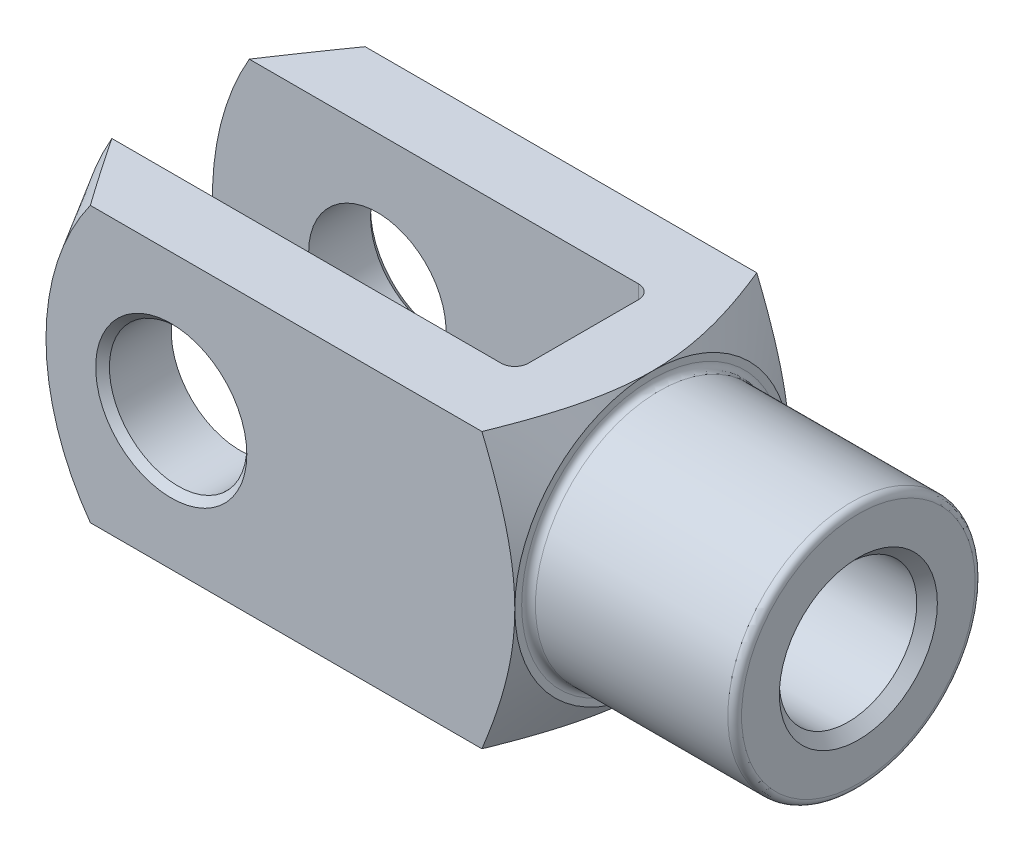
ISO-10303-21;
HEADER;
FILE_DESCRIPTION(('STEP AP214'),'2;1');
FILE_NAME('part.step','',(''),(''),'','','');
FILE_SCHEMA(('AUTOMOTIVE_DESIGN { 1 0 10303 214 1 1 1 1 }'));
ENDSEC;
DATA;
#1=APPLICATION_CONTEXT('core data for automotive mechanical design processes');
#2=APPLICATION_PROTOCOL_DEFINITION('international standard','automotive_design',2000,#1);
#3=PRODUCT_CONTEXT('',#1,'mechanical');
#4=PRODUCT('Part','Part','',(#3));
#5=PRODUCT_RELATED_PRODUCT_CATEGORY('part','',(#4));
#6=PRODUCT_DEFINITION_FORMATION('','',#4);
#7=PRODUCT_DEFINITION_CONTEXT('part definition',#1,'design');
#8=PRODUCT_DEFINITION('design','',#6,#7);
#9=PRODUCT_DEFINITION_SHAPE('','',#8);
#10=(LENGTH_UNIT() NAMED_UNIT(*) SI_UNIT(.MILLI.,.METRE.));
#11=(NAMED_UNIT(*) PLANE_ANGLE_UNIT() SI_UNIT($,.RADIAN.));
#12=(NAMED_UNIT(*) SI_UNIT($,.STERADIAN.) SOLID_ANGLE_UNIT());
#13=UNCERTAINTY_MEASURE_WITH_UNIT(LENGTH_MEASURE(1.E-05),#10,'distance_accuracy_value','');
#14=(GEOMETRIC_REPRESENTATION_CONTEXT(3) GLOBAL_UNCERTAINTY_ASSIGNED_CONTEXT((#13)) GLOBAL_UNIT_ASSIGNED_CONTEXT((#10,
#11,#12)) REPRESENTATION_CONTEXT('',''));
#15=CARTESIAN_POINT('',(0.,0.,0.));
#16=DIRECTION('',(0.,0.,1.));
#17=DIRECTION('',(1.,0.,0.));
#18=AXIS2_PLACEMENT_3D('',#15,#16,#17);
#19=CARTESIAN_POINT('',(-21.,-10.,-3.99999999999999));
#20=DIRECTION('',(0.,-1.,0.));
#21=DIRECTION('',(0.,0.,-1.));
#22=AXIS2_PLACEMENT_3D('',#19,#20,#21);
#23=CYLINDRICAL_SURFACE('',#22,1.);
#24=DIRECTION('',(0.,1.,0.));
#25=VECTOR('',#24,1.);
#26=CARTESIAN_POINT('',(-20.,-10.,-3.99999999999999));
#27=LINE('',#26,#25);
#28=CARTESIAN_POINT('',(-20.,-3.00000000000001,-3.99999999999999));
#29=VERTEX_POINT('',#28);
#30=CARTESIAN_POINT('',(-20.,-10.,-3.99999999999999));
#31=VERTEX_POINT('',#30);
#32=EDGE_CURVE('E359',#29,#31,#27,.F.);
#33=ORIENTED_EDGE('',*,*,#32,.F.);
#34=CARTESIAN_POINT('',(-20.,-3.00000000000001,-3.99999999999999));
#35=CARTESIAN_POINT('',(-20.0000371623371,-2.93694469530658,-4.04730456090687));
#36=CARTESIAN_POINT('',(-20.0033524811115,-2.87282528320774,-4.09305159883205));
#37=CARTESIAN_POINT('',(-20.0155357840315,-2.74298227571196,-4.18116773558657));
#38=CARTESIAN_POINT('',(-20.0243931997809,-2.67726196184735,-4.22354309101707));
#39=CARTESIAN_POINT('',(-20.0465893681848,-2.54494770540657,-4.30455906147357));
#40=CARTESIAN_POINT('',(-20.0598973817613,-2.47836268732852,-4.34322301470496));
#41=CARTESIAN_POINT('',(-20.0902730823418,-2.34411430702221,-4.41712604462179));
#42=CARTESIAN_POINT('',(-20.1073432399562,-2.2764502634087,-4.4523628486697));
#43=CARTESIAN_POINT('',(-20.1564689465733,-2.09692992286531,-4.54073885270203));
#44=CARTESIAN_POINT('',(-20.1911463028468,-1.98436263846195,-4.59099447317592));
#45=CARTESIAN_POINT('',(-20.2666906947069,-1.75765553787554,-4.68247844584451));
#46=CARTESIAN_POINT('',(-20.3075603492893,-1.64351507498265,-4.72370296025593));
#47=CARTESIAN_POINT('',(-20.3940114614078,-1.41369488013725,-4.79750849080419));
#48=CARTESIAN_POINT('',(-20.4396106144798,-1.29801088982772,-4.83005529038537));
#49=CARTESIAN_POINT('',(-20.534047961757,-1.06592793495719,-4.88651783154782));
#50=CARTESIAN_POINT('',(-20.5828851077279,-0.949529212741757,-4.91043635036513));
#51=CARTESIAN_POINT('',(-20.6911535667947,-0.696523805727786,-4.95317913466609));
#52=CARTESIAN_POINT('',(-20.7509805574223,-0.559826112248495,-4.97045955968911));
#53=CARTESIAN_POINT('',(-20.8719499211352,-0.286372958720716,-4.99367348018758));
#54=CARTESIAN_POINT('',(-20.9330893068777,-0.149618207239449,-4.99963044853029));
#55=CARTESIAN_POINT('',(-20.9961510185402,-0.00860658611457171,-4.99999444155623));
#56=CARTESIAN_POINT('',(-20.9980755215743,-0.00430326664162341,-4.99999999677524));
#57=CARTESIAN_POINT('',(-21.,0.,-5.));
#58=B_SPLINE_CURVE_WITH_KNOTS('',3,(#34,#35,#36,#37,#38,#39,#40,#41,#42,#43,#44,#45,#46,#47,#48,
#49,#50,#51,#52,#53,#54,#55,#56,#57),.UNSPECIFIED.,.F.,.F.,(4,2,2,2,2,2,2,2,2,2,2,4),(0.,
0.236272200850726,0.472095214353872,0.706321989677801,0.940703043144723,1.3242927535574,
1.70804515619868,2.09328905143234,2.4784088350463,2.92860728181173,3.37787147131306,
3.39201361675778),.UNSPECIFIED.);
#59=CARTESIAN_POINT('',(-21.,0.,-5.));
#60=VERTEX_POINT('',#59);
#61=EDGE_CURVE('E389',#29,#60,#58,.T.);
#62=ORIENTED_EDGE('',*,*,#61,.T.);
#63=DIRECTION('',(0.,1.,0.));
#64=VECTOR('',#63,1.);
#65=CARTESIAN_POINT('',(-21.,10.,-4.99999999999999));
#66=LINE('',#65,#64);
#67=CARTESIAN_POINT('',(-21.,-10.,-4.99999999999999));
#68=VERTEX_POINT('',#67);
#69=EDGE_CURVE('E183',#68,#60,#66,.T.);
#70=ORIENTED_EDGE('',*,*,#69,.F.);
#71=CARTESIAN_POINT('',(-21.,-10.,-3.99999999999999));
#72=DIRECTION('',(0.,-1.,0.));
#73=DIRECTION('',(0.,0.,-1.));
#74=AXIS2_PLACEMENT_3D('',#71,#72,#73);
#75=CIRCLE('',#74,1.);
#76=EDGE_CURVE('E198',#31,#68,#75,.F.);
#77=ORIENTED_EDGE('',*,*,#76,.F.);
#78=EDGE_LOOP('',(#33,#62,#70,#77));
#79=FACE_BOUND('',#78,.T.);
#80=ADVANCED_FACE('F37',(#79),#23,.F.);
#81=CARTESIAN_POINT('',(-20.,-10.,-4.99999999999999));
#82=DIRECTION('',(1.,0.,0.));
#83=DIRECTION('',(0.,0.,-1.));
#84=AXIS2_PLACEMENT_3D('',#81,#82,#83);
#85=PLANE('',#84);
#86=CARTESIAN_POINT('',(-20.,10.,-3.99999999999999));
#87=VERTEX_POINT('',#86);
#88=CARTESIAN_POINT('',(-20.,3.00000000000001,-3.99999999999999));
#89=VERTEX_POINT('',#88);
#90=EDGE_CURVE('E374',#87,#89,#27,.F.);
#91=ORIENTED_EDGE('',*,*,#90,.T.);
#92=CARTESIAN_POINT('',(-20.,0.,0.));
#93=DIRECTION('',(1.,0.,0.));
#94=DIRECTION('',(0.,0.,-1.));
#95=AXIS2_PLACEMENT_3D('',#92,#93,#94);
#96=CIRCLE('',#95,5.);
#97=CARTESIAN_POINT('',(-20.,3.,4.));
#98=VERTEX_POINT('',#97);
#99=EDGE_CURVE('E418',#89,#98,#96,.T.);
#100=ORIENTED_EDGE('',*,*,#99,.T.);
#101=DIRECTION('',(0.,1.,0.));
#102=VECTOR('',#101,1.);
#103=CARTESIAN_POINT('',(-20.,10.,4.));
#104=LINE('',#103,#102);
#105=CARTESIAN_POINT('',(-20.,10.,4.));
#106=VERTEX_POINT('',#105);
#107=EDGE_CURVE('E160',#98,#106,#104,.T.);
#108=ORIENTED_EDGE('',*,*,#107,.T.);
#109=DIRECTION('',(0.,0.,-1.));
#110=VECTOR('',#109,1.);
#111=CARTESIAN_POINT('',(-20.,10.,-4.99999999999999));
#112=LINE('',#111,#110);
#113=EDGE_CURVE('E339',#106,#87,#112,.T.);
#114=ORIENTED_EDGE('',*,*,#113,.T.);
#115=EDGE_LOOP('',(#91,#100,#108,#114));
#116=FACE_BOUND('',#115,.T.);
#117=ADVANCED_FACE('F499',(#116),#85,.F.);
#118=CARTESIAN_POINT('',(-21.,-10.,4.));
#119=DIRECTION('',(0.,-1.,0.));
#120=DIRECTION('',(0.,0.,-1.));
#121=AXIS2_PLACEMENT_3D('',#118,#119,#120);
#122=CYLINDRICAL_SURFACE('',#121,1.);
#123=ORIENTED_EDGE('',*,*,#107,.F.);
#124=CARTESIAN_POINT('',(-20.,3.,4.));
#125=CARTESIAN_POINT('',(-20.0000371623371,2.9369446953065,4.04730456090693));
#126=CARTESIAN_POINT('',(-20.0033524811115,2.87282528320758,4.09305159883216));
#127=CARTESIAN_POINT('',(-20.0155357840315,2.74298227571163,4.18116773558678));
#128=CARTESIAN_POINT('',(-20.024393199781,2.67726196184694,4.22354309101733));
#129=CARTESIAN_POINT('',(-20.0465893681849,2.54494770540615,4.30455906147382));
#130=CARTESIAN_POINT('',(-20.0598973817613,2.47836268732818,4.34322301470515));
#131=CARTESIAN_POINT('',(-20.0902730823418,2.34411430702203,4.41712604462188));
#132=CARTESIAN_POINT('',(-20.1073432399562,2.2764502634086,4.45236284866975));
#133=CARTESIAN_POINT('',(-20.1564689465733,2.09692992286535,4.54073885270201));
#134=CARTESIAN_POINT('',(-20.1911463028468,1.98436263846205,4.59099447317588));
#135=CARTESIAN_POINT('',(-20.2666906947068,1.75765553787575,4.68247844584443));
#136=CARTESIAN_POINT('',(-20.3075603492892,1.64351507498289,4.72370296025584));
#137=CARTESIAN_POINT('',(-20.3940114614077,1.41369488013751,4.79750849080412));
#138=CARTESIAN_POINT('',(-20.4396106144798,1.29801088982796,4.83005529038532));
#139=CARTESIAN_POINT('',(-20.5340479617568,1.06592793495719,4.88651783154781));
#140=CARTESIAN_POINT('',(-20.5828851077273,0.94952921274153,4.91043635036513));
#141=CARTESIAN_POINT('',(-20.6911535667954,0.696523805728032,4.9531791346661));
#142=CARTESIAN_POINT('',(-20.7509805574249,0.559826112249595,4.97045955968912));
#143=CARTESIAN_POINT('',(-20.8719499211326,0.286372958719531,4.99367348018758));
#144=CARTESIAN_POINT('',(-20.9330893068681,0.149618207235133,4.99963044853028));
#145=CARTESIAN_POINT('',(-20.9961510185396,0.00860658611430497,4.99999444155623));
#146=CARTESIAN_POINT('',(-20.998075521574,0.0043032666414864,4.99999999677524));
#147=CARTESIAN_POINT('',(-21.,0.,5.));
#148=B_SPLINE_CURVE_WITH_KNOTS('',3,(#124,#125,#126,#127,#128,#129,#130,#131,#132,#133,#134,
#135,#136,#137,#138,#139,#140,#141,#142,#143,#144,#145,#146,#147),.UNSPECIFIED.,.F.,.F.,(4,2,2,
2,2,2,2,2,2,2,2,4),(0.,0.236272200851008,0.472095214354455,0.706321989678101,0.940703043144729,
1.32429275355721,1.70804515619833,2.0932890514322,2.47840883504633,2.92860728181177,
3.37787147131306,3.39201361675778),.UNSPECIFIED.);
#149=CARTESIAN_POINT('',(-21.,0.,5.));
#150=VERTEX_POINT('',#149);
#151=EDGE_CURVE('E145',#98,#150,#148,.T.);
#152=ORIENTED_EDGE('',*,*,#151,.T.);
#153=DIRECTION('',(0.,1.,0.));
#154=VECTOR('',#153,1.);
#155=CARTESIAN_POINT('',(-21.,-10.,5.));
#156=LINE('',#155,#154);
#157=CARTESIAN_POINT('',(-21.,10.,5.));
#158=VERTEX_POINT('',#157);
#159=EDGE_CURVE('E159',#158,#150,#156,.F.);
#160=ORIENTED_EDGE('',*,*,#159,.F.);
#161=CARTESIAN_POINT('',(-21.,10.,4.));
#162=DIRECTION('',(0.,1.,0.));
#163=DIRECTION('',(0.,0.,1.));
#164=AXIS2_PLACEMENT_3D('',#161,#162,#163);
#165=CIRCLE('',#164,1.);
#166=EDGE_CURVE('E190',#106,#158,#165,.F.);
#167=ORIENTED_EDGE('',*,*,#166,.F.);
#168=EDGE_LOOP('',(#123,#152,#160,#167));
#169=FACE_BOUND('',#168,.T.);
#170=ADVANCED_FACE('F156',(#169),#122,.F.);
#171=CARTESIAN_POINT('',(-52.,-10.,-4.99999999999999));
#172=DIRECTION('',(0.,0.,-1.));
#173=DIRECTION('',(-1.,0.,0.));
#174=AXIS2_PLACEMENT_3D('',#171,#172,#173);
#175=PLANE('',#174);
#176=CARTESIAN_POINT('',(-40.,0.,-4.99999999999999));
#177=DIRECTION('',(0.,0.,-1.));
#178=DIRECTION('',(-1.,0.,0.));
#179=AXIS2_PLACEMENT_3D('',#176,#177,#178);
#180=CIRCLE('',#179,5.);
#181=CARTESIAN_POINT('',(-45.,0.,-4.99999999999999));
#182=VERTEX_POINT('',#181);
#183=EDGE_CURVE('E369',#182,#182,#180,.F.);
#184=ORIENTED_EDGE('',*,*,#183,.F.);
#185=EDGE_LOOP('',(#184));
#186=FACE_BOUND('',#185,.T.);
#187=CARTESIAN_POINT('',(-32.,0.,-4.99999999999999));
#188=DIRECTION('',(0.,0.,1.));
#189=DIRECTION('',(1.,0.,0.));
#190=AXIS2_PLACEMENT_3D('',#187,#188,#189);
#191=CIRCLE('',#190,20.);
#192=CARTESIAN_POINT('',(-49.3205080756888,10.,-4.99999999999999));
#193=VERTEX_POINT('',#192);
#194=CARTESIAN_POINT('',(-49.3205080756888,-10.,-4.99999999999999));
#195=VERTEX_POINT('',#194);
#196=EDGE_CURVE('E277',#193,#195,#191,.T.);
#197=ORIENTED_EDGE('',*,*,#196,.T.);
#198=DIRECTION('',(-1.,0.,0.));
#199=VECTOR('',#198,1.);
#200=CARTESIAN_POINT('',(-52.,-10.,-4.99999999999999));
#201=LINE('',#200,#199);
#202=EDGE_CURVE('E334',#68,#195,#201,.T.);
#203=ORIENTED_EDGE('',*,*,#202,.F.);
#204=ORIENTED_EDGE('',*,*,#69,.T.);
#205=CARTESIAN_POINT('',(-21.,10.,-4.99999999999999));
#206=VERTEX_POINT('',#205);
#207=EDGE_CURVE('E179',#60,#206,#66,.T.);
#208=ORIENTED_EDGE('',*,*,#207,.T.);
#209=DIRECTION('',(-1.,0.,0.));
#210=VECTOR('',#209,1.);
#211=CARTESIAN_POINT('',(-52.,10.,-4.99999999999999));
#212=LINE('',#211,#210);
#213=EDGE_CURVE('E347',#206,#193,#212,.T.);
#214=ORIENTED_EDGE('',*,*,#213,.T.);
#215=EDGE_LOOP('',(#197,#203,#204,#208,#214));
#216=FACE_BOUND('',#215,.T.);
#217=ADVANCED_FACE('F392',(#186,#216),#175,.F.);
#218=CARTESIAN_POINT('',(-52.,-10.,5.00000000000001));
#219=DIRECTION('',(0.,0.,1.));
#220=DIRECTION('',(1.,0.,0.));
#221=AXIS2_PLACEMENT_3D('',#218,#219,#220);
#222=PLANE('',#221);
#223=CARTESIAN_POINT('',(-40.,0.,5.));
#224=DIRECTION('',(0.,0.,1.));
#225=DIRECTION('',(1.,0.,0.));
#226=AXIS2_PLACEMENT_3D('',#223,#224,#225);
#227=CIRCLE('',#226,5.);
#228=CARTESIAN_POINT('',(-35.,0.,5.));
#229=VERTEX_POINT('',#228);
#230=EDGE_CURVE('E346',#229,#229,#227,.F.);
#231=ORIENTED_EDGE('',*,*,#230,.F.);
#232=EDGE_LOOP('',(#231));
#233=FACE_BOUND('',#232,.T.);
#234=DIRECTION('',(1.,0.,0.));
#235=VECTOR('',#234,1.);
#236=CARTESIAN_POINT('',(-52.,-10.,5.00000000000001));
#237=LINE('',#236,#235);
#238=CARTESIAN_POINT('',(-49.3205080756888,-10.,5.00000000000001));
#239=VERTEX_POINT('',#238);
#240=CARTESIAN_POINT('',(-21.,-10.,5.));
#241=VERTEX_POINT('',#240);
#242=EDGE_CURVE('E338',#239,#241,#237,.T.);
#243=ORIENTED_EDGE('',*,*,#242,.F.);
#244=CARTESIAN_POINT('',(-32.,0.,5.00000000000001));
#245=DIRECTION('',(0.,0.,1.));
#246=DIRECTION('',(1.,0.,0.));
#247=AXIS2_PLACEMENT_3D('',#244,#245,#246);
#248=CIRCLE('',#247,20.);
#249=CARTESIAN_POINT('',(-49.3205080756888,10.,5.00000000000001));
#250=VERTEX_POINT('',#249);
#251=EDGE_CURVE('E413',#250,#239,#248,.T.);
#252=ORIENTED_EDGE('',*,*,#251,.F.);
#253=DIRECTION('',(1.,0.,0.));
#254=VECTOR('',#253,1.);
#255=CARTESIAN_POINT('',(-52.,10.,5.00000000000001));
#256=LINE('',#255,#254);
#257=EDGE_CURVE('E176',#250,#158,#256,.T.);
#258=ORIENTED_EDGE('',*,*,#257,.T.);
#259=ORIENTED_EDGE('',*,*,#159,.T.);
#260=EDGE_CURVE('E164',#150,#241,#156,.F.);
#261=ORIENTED_EDGE('',*,*,#260,.T.);
#262=EDGE_LOOP('',(#243,#252,#258,#259,#261));
#263=FACE_BOUND('',#262,.T.);
#264=ADVANCED_FACE('F173',(#233,#263),#222,.F.);
#265=CARTESIAN_POINT('',(-52.,-10.,10.));
#266=DIRECTION('',(0.,0.,1.));
#267=DIRECTION('',(1.,0.,0.));
#268=AXIS2_PLACEMENT_3D('',#265,#266,#267);
#269=PLANE('',#268);
#270=CARTESIAN_POINT('',(-40.,0.,10.));
#271=DIRECTION('',(0.,0.,1.));
#272=DIRECTION('',(1.,0.,0.));
#273=AXIS2_PLACEMENT_3D('',#270,#271,#272);
#274=CIRCLE('',#273,5.49999999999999);
#275=CARTESIAN_POINT('',(-34.5,0.,10.));
#276=VERTEX_POINT('',#275);
#277=EDGE_CURVE('E229',#276,#276,#274,.F.);
#278=ORIENTED_EDGE('',*,*,#277,.T.);
#279=EDGE_LOOP('',(#278));
#280=FACE_BOUND('',#279,.T.);
#281=DIRECTION('',(1.,0.,0.));
#282=VECTOR('',#281,1.);
#283=CARTESIAN_POINT('',(-52.,10.,10.));
#284=LINE('',#283,#282);
#285=CARTESIAN_POINT('',(-45.8875224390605,10.,10.));
#286=VERTEX_POINT('',#285);
#287=CARTESIAN_POINT('',(-17.391463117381,10.,10.));
#288=VERTEX_POINT('',#287);
#289=EDGE_CURVE('E366',#286,#288,#284,.T.);
#290=ORIENTED_EDGE('',*,*,#289,.F.);
#291=CARTESIAN_POINT('',(-32.,0.,10.));
#292=DIRECTION('',(0.,0.,1.));
#293=DIRECTION('',(1.,0.,0.));
#294=AXIS2_PLACEMENT_3D('',#291,#292,#293);
#295=CIRCLE('',#294,17.1132486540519);
#296=CARTESIAN_POINT('',(-45.8875224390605,-10.,10.));
#297=VERTEX_POINT('',#296);
#298=EDGE_CURVE('E61',#286,#297,#295,.T.);
#299=ORIENTED_EDGE('',*,*,#298,.T.);
#300=DIRECTION('',(1.,0.,0.));
#301=VECTOR('',#300,1.);
#302=CARTESIAN_POINT('',(-52.,-10.,10.));
#303=LINE('',#302,#301);
#304=CARTESIAN_POINT('',(-17.391463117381,-10.,10.));
#305=VERTEX_POINT('',#304);
#306=EDGE_CURVE('E363',#297,#305,#303,.T.);
#307=ORIENTED_EDGE('',*,*,#306,.T.);
#308=CARTESIAN_POINT('',(-22.3558734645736,-20.4240435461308,10.));
#309=CARTESIAN_POINT('',(-22.1003465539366,-19.9311836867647,10.));
#310=CARTESIAN_POINT('',(-21.8461705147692,-19.4376169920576,10.));
#311=CARTESIAN_POINT('',(-21.3412365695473,-18.4487061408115,10.));
#312=CARTESIAN_POINT('',(-21.0904788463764,-17.9533618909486,10.));
#313=CARTESIAN_POINT('',(-20.5926922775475,-16.9597202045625,10.));
#314=CARTESIAN_POINT('',(-20.3456706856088,-16.4614191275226,10.));
#315=CARTESIAN_POINT('',(-19.8568264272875,-15.4622801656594,10.));
#316=CARTESIAN_POINT('',(-19.6150036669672,-14.9614423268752,10.));
#317=CARTESIAN_POINT('',(-19.1232043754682,-13.9257515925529,10.));
#318=CARTESIAN_POINT('',(-18.8736415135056,-13.3907016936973,10.));
#319=CARTESIAN_POINT('',(-18.3840144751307,-12.3162208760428,10.));
#320=CARTESIAN_POINT('',(-18.1439507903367,-11.7767897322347,10.));
#321=CARTESIAN_POINT('',(-17.6764473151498,-10.6927476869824,10.));
#322=CARTESIAN_POINT('',(-17.4490019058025,-10.1481392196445,10.));
#323=CARTESIAN_POINT('',(-17.0108100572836,-9.05224110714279,10.));
#324=CARTESIAN_POINT('',(-16.8000616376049,-8.50095226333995,10.));
#325=CARTESIAN_POINT('',(-16.4792530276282,-7.60769970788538,10.));
#326=CARTESIAN_POINT('',(-16.3620787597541,-7.26829451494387,10.));
#327=CARTESIAN_POINT('',(-16.1378183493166,-6.58617800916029,10.));
#328=CARTESIAN_POINT('',(-16.0307313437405,-6.24346698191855,10.));
#329=CARTESIAN_POINT('',(-15.828626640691,-5.55448777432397,10.));
#330=CARTESIAN_POINT('',(-15.733608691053,-5.2082196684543,10.));
#331=CARTESIAN_POINT('',(-15.5579131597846,-4.51203468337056,10.));
#332=CARTESIAN_POINT('',(-15.4772354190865,-4.16211784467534,10.));
#333=CARTESIAN_POINT('',(-15.3343492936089,-3.46705706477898,10.));
#334=CARTESIAN_POINT('',(-15.2717518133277,-3.12199390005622,10.));
#335=CARTESIAN_POINT('',(-15.1647579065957,-2.42903327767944,10.));
#336=CARTESIAN_POINT('',(-15.1203608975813,-2.08113591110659,10.));
#337=CARTESIAN_POINT('',(-15.0516237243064,-1.38356903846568,10.));
#338=CARTESIAN_POINT('',(-15.0272704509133,-1.03390084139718,10.));
#339=CARTESIAN_POINT('',(-14.9996951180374,-0.333728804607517,10.));
#340=CARTESIAN_POINT('',(-14.9964723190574,0.0167750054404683,10.));
#341=CARTESIAN_POINT('',(-15.010762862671,0.691790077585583,10.));
#342=CARTESIAN_POINT('',(-15.0267823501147,1.01633432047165,10.));
#343=CARTESIAN_POINT('',(-15.0764553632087,1.66405607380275,10.));
#344=CARTESIAN_POINT('',(-15.1101088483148,1.98723358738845,10.));
#345=CARTESIAN_POINT('',(-15.1938161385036,2.6316030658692,10.));
#346=CARTESIAN_POINT('',(-15.2438784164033,2.95279391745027,10.));
#347=CARTESIAN_POINT('',(-15.3587527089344,3.59250988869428,10.));
#348=CARTESIAN_POINT('',(-15.4235651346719,3.91103493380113,10.));
#349=CARTESIAN_POINT('',(-15.5682001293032,4.55432870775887,10.));
#350=CARTESIAN_POINT('',(-15.6484028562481,4.87901130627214,10.));
#351=CARTESIAN_POINT('',(-15.8205817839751,5.52521807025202,10.));
#352=CARTESIAN_POINT('',(-15.9125580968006,5.84674220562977,10.));
#353=CARTESIAN_POINT('',(-16.1065044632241,6.48673250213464,10.));
#354=CARTESIAN_POINT('',(-16.2084740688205,6.80519879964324,10.));
#355=CARTESIAN_POINT('',(-16.3677555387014,7.28075232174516,10.));
#356=CARTESIAN_POINT('',(-16.4219029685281,7.43891003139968,10.));
#357=CARTESIAN_POINT('',(-16.5321392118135,7.7545471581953,10.));
#358=CARTESIAN_POINT('',(-16.5882280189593,7.91202657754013,10.));
#359=CARTESIAN_POINT('',(-16.7684482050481,8.40910944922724,10.));
#360=CARTESIAN_POINT('',(-16.8958517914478,8.74752927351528,10.));
#361=CARTESIAN_POINT('',(-17.1575763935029,9.42169147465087,10.));
#362=CARTESIAN_POINT('',(-17.2918978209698,9.75743369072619,10.));
#363=CARTESIAN_POINT('',(-17.5663381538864,10.4266152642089,10.));
#364=CARTESIAN_POINT('',(-17.7064582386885,10.7600541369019,10.));
#365=CARTESIAN_POINT('',(-17.9915396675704,11.4248600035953,10.));
#366=CARTESIAN_POINT('',(-18.1365011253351,11.7562269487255,10.));
#367=CARTESIAN_POINT('',(-18.4306248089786,12.4174211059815,10.));
#368=CARTESIAN_POINT('',(-18.579790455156,12.7472467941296,10.));
#369=CARTESIAN_POINT('',(-18.8815899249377,13.4053092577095,10.));
#370=CARTESIAN_POINT('',(-19.0342237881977,13.7335460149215,10.));
#371=CARTESIAN_POINT('',(-19.496500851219,14.7160981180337,10.));
#372=CARTESIAN_POINT('',(-19.8105565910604,15.3683378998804,10.));
#373=CARTESIAN_POINT('',(-20.4483163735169,16.6705289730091,10.));
#374=CARTESIAN_POINT('',(-20.7720469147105,17.3204672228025,10.));
#375=CARTESIAN_POINT('',(-21.4261391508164,18.6170111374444,10.));
#376=CARTESIAN_POINT('',(-21.7565009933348,19.2636167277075,10.));
#377=CARTESIAN_POINT('',(-22.4221745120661,20.5538665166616,10.));
#378=CARTESIAN_POINT('',(-22.7574836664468,21.1975120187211,10.));
#379=CARTESIAN_POINT('',(-23.4321254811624,22.4826820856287,10.));
#380=CARTESIAN_POINT('',(-23.7714581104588,23.1242066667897,10.));
#381=CARTESIAN_POINT('',(-24.6929935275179,24.8559334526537,10.));
#382=CARTESIAN_POINT('',(-25.2782369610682,25.9445168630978,10.));
#383=CARTESIAN_POINT('',(-26.4553238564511,28.1183008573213,10.));
#384=CARTESIAN_POINT('',(-27.0471682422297,29.2035009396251,10.));
#385=CARTESIAN_POINT('',(-28.2322304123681,31.3650726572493,10.));
#386=CARTESIAN_POINT('',(-28.8254209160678,32.4414592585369,10.));
#387=CARTESIAN_POINT('',(-29.7178280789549,34.0544764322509,10.));
#388=CARTESIAN_POINT('',(-30.0157104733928,34.5918461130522,10.));
#389=CARTESIAN_POINT('',(-30.6122603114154,35.666148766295,10.));
#390=CARTESIAN_POINT('',(-30.9109277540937,36.2030817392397,10.));
#391=CARTESIAN_POINT('',(-31.2099360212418,36.7398248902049,10.));
#392=B_SPLINE_CURVE_WITH_KNOTS('',3,(#308,#309,#310,#311,#312,#313,#314,#315,#316,#317,#318,
#319,#320,#321,#322,#323,#324,#325,#326,#327,#328,#329,#330,#331,#332,#333,#334,#335,#336,#337,
#338,#339,#340,#341,#342,#343,#344,#345,#346,#347,#348,#349,#350,#351,#352,#353,#354,#355,#356,
#357,#358,#359,#360,#361,#362,#363,#364,#365,#366,#367,#368,#369,#370,#371,#372,#373,#374,#375,
#376,#377,#378,#379,#380,#381,#382,#383,#384,#385,#386,#387,#388,#389,#390,#391),.UNSPECIFIED.,
.F.,.F.,(4,2,2,2,2,2,2,2,2,2,2,2,2,2,2,2,2,2,2,2,2,2,2,2,2,2,2,2,2,2,2,2,2,2,2,2,2,2,2,2,2,4),
(0.,1.66549246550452,3.33107368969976,4.99955529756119,6.66800673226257,8.43910594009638,
10.2102966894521,11.980692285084,13.7508775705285,14.8279395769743,15.9049093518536,
16.9818566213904,18.0587919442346,19.1104471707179,20.162068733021,21.2130019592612,
22.2638984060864,23.2382198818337,24.2125391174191,25.1873622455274,26.1622125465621,
27.1652790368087,28.1683550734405,29.1713861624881,29.6728858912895,30.1743839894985,
31.2591028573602,32.3438863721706,33.4288916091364,34.5139223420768,35.59986283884,
36.685815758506,38.857450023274,41.0357057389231,43.2140099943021,45.3912398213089,
47.5684528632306,51.2762079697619,54.9844887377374,58.6715305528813,60.5147611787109,
62.3579896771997),.UNSPECIFIED.);
#393=CARTESIAN_POINT('',(-15.,0.,10.));
#394=VERTEX_POINT('',#393);
#395=EDGE_CURVE('E306',#394,#305,#392,.F.);
#396=ORIENTED_EDGE('',*,*,#395,.F.);
#397=EDGE_CURVE('E304',#288,#394,#392,.F.);
#398=ORIENTED_EDGE('',*,*,#397,.F.);
#399=EDGE_LOOP('',(#290,#299,#307,#396,#398));
#400=FACE_BOUND('',#399,.T.);
#401=ADVANCED_FACE('F288',(#280,#400),#269,.T.);
#402=CARTESIAN_POINT('',(-52.,-10.,10.));
#403=DIRECTION('',(0.,-1.,0.));
#404=DIRECTION('',(0.,0.,-1.));
#405=AXIS2_PLACEMENT_3D('',#402,#403,#404);
#406=PLANE('',#405);
#407=ORIENTED_EDGE('',*,*,#202,.T.);
#408=CARTESIAN_POINT('',(-57.2321898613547,-10.,7.36951687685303));
#409=CARTESIAN_POINT('',(-56.745633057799,-10.,6.58611648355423));
#410=CARTESIAN_POINT('',(-56.2577437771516,-10.,5.80353993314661));
#411=CARTESIAN_POINT('',(-55.2786767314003,-10.,4.24042523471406));
#412=CARTESIAN_POINT('',(-54.7874989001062,-10.,3.45988712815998));
#413=CARTESIAN_POINT('',(-53.8006621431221,-10.,1.90034138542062));
#414=CARTESIAN_POINT('',(-53.3049985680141,-10.,1.12133668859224));
#415=CARTESIAN_POINT('',(-52.3089364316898,-10.,-0.433632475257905));
#416=CARTESIAN_POINT('',(-51.8085379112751,-10.,-1.20959696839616));
#417=CARTESIAN_POINT('',(-50.7809631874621,-10.,-2.78997730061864));
#418=CARTESIAN_POINT('',(-50.2535395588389,-10.,-3.59423250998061));
#419=CARTESIAN_POINT('',(-49.1907284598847,-10.,-5.19745714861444));
#420=CARTESIAN_POINT('',(-48.6553410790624,-10.,-5.99642663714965));
#421=CARTESIAN_POINT('',(-47.5747096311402,-10.,-7.58683469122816));
#422=CARTESIAN_POINT('',(-47.0294731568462,-10.,-8.37827839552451));
#423=CARTESIAN_POINT('',(-46.2014533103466,-10.,-9.55828753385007));
#424=CARTESIAN_POINT('',(-45.9237578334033,-10.,-9.95042385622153));
#425=CARTESIAN_POINT('',(-45.3644017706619,-10.,-10.7318561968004));
#426=CARTESIAN_POINT('',(-45.0827412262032,-10.,-11.121152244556));
#427=CARTESIAN_POINT('',(-44.5174190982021,-10.,-11.8927308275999));
#428=CARTESIAN_POINT('',(-44.2338006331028,-10.,-12.275044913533));
#429=CARTESIAN_POINT('',(-43.6611630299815,-10.,-13.0356258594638));
#430=CARTESIAN_POINT('',(-43.3721437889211,-10.,-13.4138926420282));
#431=CARTESIAN_POINT('',(-42.7872589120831,-10.,-14.1659406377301));
#432=CARTESIAN_POINT('',(-42.4913844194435,-10.,-14.5397149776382));
#433=CARTESIAN_POINT('',(-41.8918382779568,-10.,-15.2809455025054));
#434=CARTESIAN_POINT('',(-41.5881670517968,-10.,-15.6484020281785));
#435=CARTESIAN_POINT('',(-40.9744614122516,-10.,-16.3714518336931));
#436=CARTESIAN_POINT('',(-40.6645256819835,-10.,-16.7271286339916));
#437=CARTESIAN_POINT('',(-40.0329680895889,-10.,-17.4282054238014));
#438=CARTESIAN_POINT('',(-39.7113432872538,-10.,-17.7736027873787));
#439=CARTESIAN_POINT('',(-39.2183551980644,-10.,-18.2807263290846));
#440=CARTESIAN_POINT('',(-39.0524514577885,-10.,-18.4477649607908));
#441=CARTESIAN_POINT('',(-38.716558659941,-10.,-18.7776754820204));
#442=CARTESIAN_POINT('',(-38.5465698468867,-10.,-18.9405476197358));
#443=CARTESIAN_POINT('',(-38.2020749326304,-10.,-19.2612725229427));
#444=CARTESIAN_POINT('',(-38.0275712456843,-10.,-19.4191278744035));
#445=CARTESIAN_POINT('',(-37.6733935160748,-10.,-19.7289072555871));
#446=CARTESIAN_POINT('',(-37.4937200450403,-10.,-19.8808319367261));
#447=CARTESIAN_POINT('',(-37.1220498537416,-10.,-20.1827912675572));
#448=CARTESIAN_POINT('',(-36.9298420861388,-10.,-20.3325675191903));
#449=CARTESIAN_POINT('',(-36.5383571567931,-10.,-20.6227066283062));
#450=CARTESIAN_POINT('',(-36.3390786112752,-10.,-20.7630676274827));
#451=CARTESIAN_POINT('',(-35.932846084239,-10.,-21.0319774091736));
#452=CARTESIAN_POINT('',(-35.7258982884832,-10.,-21.160535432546));
#453=CARTESIAN_POINT('',(-35.3037021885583,-10.,-21.4030294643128));
#454=CARTESIAN_POINT('',(-35.0884560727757,-10.,-21.5169692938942));
#455=CARTESIAN_POINT('',(-34.5296464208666,-10.,-21.783809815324));
#456=CARTESIAN_POINT('',(-34.1798259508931,-10.,-21.9243079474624));
#457=CARTESIAN_POINT('',(-33.6418795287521,-10.,-22.0912640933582));
#458=CARTESIAN_POINT('',(-33.4604354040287,-10.,-22.1396072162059));
#459=CARTESIAN_POINT('',(-33.093915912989,-10.,-22.2200235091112));
#460=CARTESIAN_POINT('',(-32.908840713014,-10.,-22.2520974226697));
#461=CARTESIAN_POINT('',(-32.5346022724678,-10.,-22.2988166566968));
#462=CARTESIAN_POINT('',(-32.3454166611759,-10.,-22.313284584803));
#463=CARTESIAN_POINT('',(-31.9665401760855,-10.,-22.3235178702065));
#464=CARTESIAN_POINT('',(-31.7768493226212,-10.,-22.3192839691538));
#465=CARTESIAN_POINT('',(-31.3987646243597,-10.,-22.292316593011));
#466=CARTESIAN_POINT('',(-31.2103710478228,-10.,-22.2695794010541));
#467=CARTESIAN_POINT('',(-30.8365348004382,-10.,-22.2066526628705));
#468=CARTESIAN_POINT('',(-30.6510925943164,-10.,-22.1664603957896));
#469=CARTESIAN_POINT('',(-30.2504201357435,-10.,-22.0613497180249));
#470=CARTESIAN_POINT('',(-30.0360329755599,-10.,-21.9932307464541));
#471=CARTESIAN_POINT('',(-29.6142317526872,-10.,-21.8379822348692));
#472=CARTESIAN_POINT('',(-29.4068216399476,-10.,-21.750842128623));
#473=CARTESIAN_POINT('',(-28.9988371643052,-10.,-21.5605082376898));
#474=CARTESIAN_POINT('',(-28.7982845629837,-10.,-21.4572682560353));
#475=CARTESIAN_POINT('',(-28.4045157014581,-10.,-21.2378022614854));
#476=CARTESIAN_POINT('',(-28.211298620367,-10.,-21.121577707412));
#477=CARTESIAN_POINT('',(-27.7694245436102,-10.,-20.8386610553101));
#478=CARTESIAN_POINT('',(-27.5233696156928,-10.,-20.6679192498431));
#479=CARTESIAN_POINT('',(-27.0418236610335,-10.,-20.3120669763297));
#480=CARTESIAN_POINT('',(-26.8063377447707,-10.,-20.1269496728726));
#481=CARTESIAN_POINT('',(-26.3441491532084,-10.,-19.7452386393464));
#482=CARTESIAN_POINT('',(-26.1174642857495,-10.,-19.5486234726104));
#483=CARTESIAN_POINT('',(-25.6720928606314,-10.,-19.1466530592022));
#484=CARTESIAN_POINT('',(-25.453404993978,-10.,-18.941299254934));
#485=CARTESIAN_POINT('',(-25.0214181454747,-10.,-18.5221818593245));
#486=CARTESIAN_POINT('',(-24.8081650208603,-10.,-18.3083711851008));
#487=CARTESIAN_POINT('',(-24.3876033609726,-10.,-17.8749857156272));
#488=CARTESIAN_POINT('',(-24.1802950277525,-10.,-17.6554107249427));
#489=CARTESIAN_POINT('',(-23.7710307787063,-10.,-17.2117611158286));
#490=CARTESIAN_POINT('',(-23.5690695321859,-10.,-16.9876914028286));
#491=CARTESIAN_POINT('',(-23.1696072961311,-10.,-16.5356277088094));
#492=CARTESIAN_POINT('',(-22.9721062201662,-10.,-16.3076338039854));
#493=CARTESIAN_POINT('',(-22.4999897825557,-10.,-15.7532280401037));
#494=CARTESIAN_POINT('',(-22.2273152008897,-10.,-15.4251642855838));
#495=CARTESIAN_POINT('',(-21.6883836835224,-10.,-14.7637172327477));
#496=CARTESIAN_POINT('',(-21.4221280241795,-10.,-14.4303328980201));
#497=CARTESIAN_POINT('',(-20.8990947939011,-10.,-13.7644395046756));
#498=CARTESIAN_POINT('',(-20.6422345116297,-10.,-13.4319952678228));
#499=CARTESIAN_POINT('',(-20.1331161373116,-10.,-12.7637580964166));
#500=CARTESIAN_POINT('',(-19.8808566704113,-10.,-12.4279662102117));
#501=CARTESIAN_POINT('',(-19.6304831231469,-10.,-12.0907921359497));
#502=B_SPLINE_CURVE_WITH_KNOTS('',3,(#408,#409,#410,#411,#412,#413,#414,#415,#416,#417,#418,
#419,#420,#421,#422,#423,#424,#425,#426,#427,#428,#429,#430,#431,#432,#433,#434,#435,#436,#437,
#438,#439,#440,#441,#442,#443,#444,#445,#446,#447,#448,#449,#450,#451,#452,#453,#454,#455,#456,
#457,#458,#459,#460,#461,#462,#463,#464,#465,#466,#467,#468,#469,#470,#471,#472,#473,#474,#475,
#476,#477,#478,#479,#480,#481,#482,#483,#484,#485,#486,#487,#488,#489,#490,#491,#492,#493,#494,
#495,#496,#497,#498,#499,#500,#501),.UNSPECIFIED.,.F.,.F.,(4,2,2,2,2,2,2,2,2,2,2,2,2,2,2,2,2,2,
2,2,2,2,2,2,2,2,2,2,2,2,2,2,2,2,2,2,2,2,2,2,2,2,2,2,2,2,4),(0.,2.76660478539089,
5.53326542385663,8.30322881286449,11.0731683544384,13.9584410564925,16.843681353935,
19.7267850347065,21.1682825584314,22.6097650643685,24.0378123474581,25.4658869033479,
26.8959225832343,28.3258808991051,29.7410059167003,31.1564893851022,31.8627134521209,
32.5688953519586,33.2747071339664,33.9804411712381,34.7112197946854,35.4421422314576,
36.1724874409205,36.9026413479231,38.0289522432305,38.5916651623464,39.1543523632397,
39.7226632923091,40.2909516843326,40.8593542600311,41.4278454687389,42.1016117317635,
42.7757532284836,43.4518659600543,44.1279028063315,45.0256730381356,45.9238727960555,
46.8238041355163,47.7235875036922,48.6293923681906,49.5352279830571,50.4401236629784,
51.3450017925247,52.6246585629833,53.9045677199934,55.1648707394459,56.4247907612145),.UNSPECIFIED.);
#503=CARTESIAN_POINT('',(-45.8875224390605,-9.99999999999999,-10.));
#504=VERTEX_POINT('',#503);
#505=EDGE_CURVE('E276',#195,#504,#502,.T.);
#506=ORIENTED_EDGE('',*,*,#505,.T.);
#507=DIRECTION('',(1.,0.,0.));
#508=VECTOR('',#507,1.);
#509=CARTESIAN_POINT('',(-52.,-10.,-10.));
#510=LINE('',#509,#508);
#511=CARTESIAN_POINT('',(-17.391463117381,-10.,-10.));
#512=VERTEX_POINT('',#511);
#513=EDGE_CURVE('E360',#504,#512,#510,.T.);
#514=ORIENTED_EDGE('',*,*,#513,.T.);
#515=CARTESIAN_POINT('',(-22.3558734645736,-10.,-20.4240435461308));
#516=CARTESIAN_POINT('',(-22.1003465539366,-10.,-19.9311836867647));
#517=CARTESIAN_POINT('',(-21.8461705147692,-10.,-19.4376169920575));
#518=CARTESIAN_POINT('',(-21.3412365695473,-10.,-18.4487061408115));
#519=CARTESIAN_POINT('',(-21.0904788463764,-10.,-17.9533618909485));
#520=CARTESIAN_POINT('',(-20.5926922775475,-10.,-16.9597202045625));
#521=CARTESIAN_POINT('',(-20.3456706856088,-10.,-16.4614191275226));
#522=CARTESIAN_POINT('',(-19.8568264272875,-10.,-15.4622801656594));
#523=CARTESIAN_POINT('',(-19.6150036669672,-10.,-14.9614423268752));
#524=CARTESIAN_POINT('',(-19.1232043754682,-10.,-13.9257515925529));
#525=CARTESIAN_POINT('',(-18.8736415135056,-10.,-13.3907016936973));
#526=CARTESIAN_POINT('',(-18.3840144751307,-10.,-12.3162208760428));
#527=CARTESIAN_POINT('',(-18.1439507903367,-10.,-11.7767897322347));
#528=CARTESIAN_POINT('',(-17.6764473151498,-10.,-10.6927476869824));
#529=CARTESIAN_POINT('',(-17.4490019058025,-10.,-10.1481392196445));
#530=CARTESIAN_POINT('',(-17.0108100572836,-10.,-9.05224110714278));
#531=CARTESIAN_POINT('',(-16.8000616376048,-10.,-8.50095226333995));
#532=CARTESIAN_POINT('',(-16.4792530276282,-10.,-7.60769970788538));
#533=CARTESIAN_POINT('',(-16.3620787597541,-10.,-7.26829451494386));
#534=CARTESIAN_POINT('',(-16.1378183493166,-10.,-6.58617800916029));
#535=CARTESIAN_POINT('',(-16.0307313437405,-10.,-6.24346698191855));
#536=CARTESIAN_POINT('',(-15.828626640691,-10.,-5.55448777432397));
#537=CARTESIAN_POINT('',(-15.733608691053,-10.,-5.2082196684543));
#538=CARTESIAN_POINT('',(-15.5579131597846,-10.,-4.51203468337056));
#539=CARTESIAN_POINT('',(-15.4772354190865,-10.,-4.16211784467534));
#540=CARTESIAN_POINT('',(-15.3343492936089,-10.,-3.46705706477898));
#541=CARTESIAN_POINT('',(-15.2717518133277,-10.,-3.12199390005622));
#542=CARTESIAN_POINT('',(-15.1647579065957,-10.,-2.42903327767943));
#543=CARTESIAN_POINT('',(-15.1203608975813,-10.,-2.08113591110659));
#544=CARTESIAN_POINT('',(-15.0516237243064,-10.,-1.38356903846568));
#545=CARTESIAN_POINT('',(-15.0272704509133,-10.,-1.03390084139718));
#546=CARTESIAN_POINT('',(-14.9996951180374,-10.,-0.333728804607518));
#547=CARTESIAN_POINT('',(-14.9964723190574,-10.,0.0167750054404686));
#548=CARTESIAN_POINT('',(-15.010762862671,-10.,0.691790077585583));
#549=CARTESIAN_POINT('',(-15.0267823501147,-10.,1.01633432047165));
#550=CARTESIAN_POINT('',(-15.0764553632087,-10.,1.66405607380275));
#551=CARTESIAN_POINT('',(-15.1101088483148,-10.,1.98723358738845));
#552=CARTESIAN_POINT('',(-15.1938161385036,-10.,2.6316030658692));
#553=CARTESIAN_POINT('',(-15.2438784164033,-10.,2.95279391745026));
#554=CARTESIAN_POINT('',(-15.3587527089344,-10.,3.59250988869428));
#555=CARTESIAN_POINT('',(-15.4235651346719,-10.,3.91103493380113));
#556=CARTESIAN_POINT('',(-15.5682001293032,-10.,4.55432870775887));
#557=CARTESIAN_POINT('',(-15.6484028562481,-10.,4.87901130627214));
#558=CARTESIAN_POINT('',(-15.8205817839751,-10.,5.52521807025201));
#559=CARTESIAN_POINT('',(-15.9125580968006,-10.,5.84674220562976));
#560=CARTESIAN_POINT('',(-16.1065044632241,-10.,6.48673250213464));
#561=CARTESIAN_POINT('',(-16.2084740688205,-10.,6.80519879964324));
#562=CARTESIAN_POINT('',(-16.3677555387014,-10.,7.28075232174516));
#563=CARTESIAN_POINT('',(-16.4219029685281,-10.,7.43891003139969));
#564=CARTESIAN_POINT('',(-16.5321392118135,-10.,7.7545471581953));
#565=CARTESIAN_POINT('',(-16.5882280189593,-10.,7.91202657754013));
#566=CARTESIAN_POINT('',(-16.7684482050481,-10.,8.40910944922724));
#567=CARTESIAN_POINT('',(-16.8958517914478,-10.,8.74752927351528));
#568=CARTESIAN_POINT('',(-17.1575763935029,-10.,9.42169147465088));
#569=CARTESIAN_POINT('',(-17.2918978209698,-10.,9.7574336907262));
#570=CARTESIAN_POINT('',(-17.5663381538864,-10.,10.4266152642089));
#571=CARTESIAN_POINT('',(-17.7064582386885,-10.,10.7600541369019));
#572=CARTESIAN_POINT('',(-17.9915396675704,-10.,11.4248600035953));
#573=CARTESIAN_POINT('',(-18.1365011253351,-10.,11.7562269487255));
#574=CARTESIAN_POINT('',(-18.4306248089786,-10.,12.4174211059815));
#575=CARTESIAN_POINT('',(-18.579790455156,-10.,12.7472467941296));
#576=CARTESIAN_POINT('',(-18.8815899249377,-10.,13.4053092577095));
#577=CARTESIAN_POINT('',(-19.0342237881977,-10.,13.7335460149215));
#578=CARTESIAN_POINT('',(-19.496500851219,-10.,14.7160981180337));
#579=CARTESIAN_POINT('',(-19.8105565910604,-10.,15.3683378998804));
#580=CARTESIAN_POINT('',(-20.4483163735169,-10.,16.6705289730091));
#581=CARTESIAN_POINT('',(-20.7720469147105,-10.,17.3204672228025));
#582=CARTESIAN_POINT('',(-21.4261391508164,-10.,18.6170111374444));
#583=CARTESIAN_POINT('',(-21.7565009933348,-10.,19.2636167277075));
#584=CARTESIAN_POINT('',(-22.4221745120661,-10.,20.5538665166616));
#585=CARTESIAN_POINT('',(-22.7574836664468,-10.,21.1975120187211));
#586=CARTESIAN_POINT('',(-23.4321254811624,-10.,22.4826820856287));
#587=CARTESIAN_POINT('',(-23.7714581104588,-10.,23.1242066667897));
#588=CARTESIAN_POINT('',(-24.6929935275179,-10.,24.8559334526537));
#589=CARTESIAN_POINT('',(-25.2782369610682,-10.,25.9445168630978));
#590=CARTESIAN_POINT('',(-26.4553238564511,-10.,28.1183008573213));
#591=CARTESIAN_POINT('',(-27.0471682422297,-10.,29.2035009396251));
#592=CARTESIAN_POINT('',(-28.2322304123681,-10.,31.3650726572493));
#593=CARTESIAN_POINT('',(-28.8254209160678,-10.,32.4414592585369));
#594=CARTESIAN_POINT('',(-29.7178280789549,-10.,34.0544764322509));
#595=CARTESIAN_POINT('',(-30.0157104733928,-10.,34.5918461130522));
#596=CARTESIAN_POINT('',(-30.6122603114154,-10.,35.666148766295));
#597=CARTESIAN_POINT('',(-30.9109277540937,-10.,36.2030817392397));
#598=CARTESIAN_POINT('',(-31.2099360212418,-10.,36.7398248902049));
#599=B_SPLINE_CURVE_WITH_KNOTS('',3,(#515,#516,#517,#518,#519,#520,#521,#522,#523,#524,#525,
#526,#527,#528,#529,#530,#531,#532,#533,#534,#535,#536,#537,#538,#539,#540,#541,#542,#543,#544,
#545,#546,#547,#548,#549,#550,#551,#552,#553,#554,#555,#556,#557,#558,#559,#560,#561,#562,#563,
#564,#565,#566,#567,#568,#569,#570,#571,#572,#573,#574,#575,#576,#577,#578,#579,#580,#581,#582,
#583,#584,#585,#586,#587,#588,#589,#590,#591,#592,#593,#594,#595,#596,#597,#598),.UNSPECIFIED.,
.F.,.F.,(4,2,2,2,2,2,2,2,2,2,2,2,2,2,2,2,2,2,2,2,2,2,2,2,2,2,2,2,2,2,2,2,2,2,2,2,2,2,2,2,2,4),
(0.,1.66549246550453,3.33107368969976,4.99955529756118,6.66800673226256,8.43910594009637,
10.2102966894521,11.980692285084,13.7508775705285,14.8279395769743,15.9049093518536,
16.9818566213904,18.0587919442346,19.1104471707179,20.162068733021,21.2130019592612,
22.2638984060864,23.2382198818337,24.2125391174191,25.1873622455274,26.1622125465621,
27.1652790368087,28.1683550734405,29.1713861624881,29.6728858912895,30.1743839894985,
31.2591028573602,32.3438863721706,33.4288916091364,34.5139223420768,35.59986283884,
36.685815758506,38.857450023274,41.0357057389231,43.2140099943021,45.3912398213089,
47.5684528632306,51.2762079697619,54.9844887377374,58.6715305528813,60.5147611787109,
62.3579896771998),.UNSPECIFIED.);
#600=CARTESIAN_POINT('',(-15.,-10.,0.));
#601=VERTEX_POINT('',#600);
#602=EDGE_CURVE('E305',#601,#512,#599,.F.);
#603=ORIENTED_EDGE('',*,*,#602,.F.);
#604=EDGE_CURVE('E296',#305,#601,#599,.F.);
#605=ORIENTED_EDGE('',*,*,#604,.F.);
#606=ORIENTED_EDGE('',*,*,#306,.F.);
#607=CARTESIAN_POINT('',(-19.6304831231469,-10.,12.0907921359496));
#608=CARTESIAN_POINT('',(-19.8338762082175,-10.,12.3647242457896));
#609=CARTESIAN_POINT('',(-20.0385262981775,-10.,12.6377302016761));
#610=CARTESIAN_POINT('',(-20.4507369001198,-10.,13.181565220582));
#611=CARTESIAN_POINT('',(-20.6582976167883,-10.,13.4523941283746));
#612=CARTESIAN_POINT('',(-21.0770682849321,-10.,13.9919897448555));
#613=CARTESIAN_POINT('',(-21.2882840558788,-10.,14.2607519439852));
#614=CARTESIAN_POINT('',(-21.7144777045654,-10.,14.7952707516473));
#615=CARTESIAN_POINT('',(-21.9294554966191,-10.,15.0610274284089));
#616=CARTESIAN_POINT('',(-22.3658843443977,-10.,15.5915807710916));
#617=CARTESIAN_POINT('',(-22.5873782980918,-10.,15.8563422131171));
#618=CARTESIAN_POINT('',(-23.0354910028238,-10.,16.3814896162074));
#619=CARTESIAN_POINT('',(-23.2621096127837,-10.,16.6418756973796));
#620=CARTESIAN_POINT('',(-23.7211922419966,-10.,17.1571482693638));
#621=CARTESIAN_POINT('',(-23.9536523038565,-10.,17.4120382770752));
#622=CARTESIAN_POINT('',(-24.4255997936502,-10.,17.9152070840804));
#623=CARTESIAN_POINT('',(-24.665086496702,-10.,18.163486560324));
#624=CARTESIAN_POINT('',(-25.1139682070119,-10.,18.6132180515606));
#625=CARTESIAN_POINT('',(-25.3221499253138,-10.,18.8158782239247));
#626=CARTESIAN_POINT('',(-25.7454021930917,-10.,19.2139465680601));
#627=CARTESIAN_POINT('',(-25.9604733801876,-10.,19.4093540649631));
#628=CARTESIAN_POINT('',(-26.3987029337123,-10.,19.7911821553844));
#629=CARTESIAN_POINT('',(-26.6218657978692,-10.,19.9775976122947));
#630=CARTESIAN_POINT('',(-27.0773953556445,-10.,20.3388644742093));
#631=CARTESIAN_POINT('',(-27.3097609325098,-10.,20.5137172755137));
#632=CARTESIAN_POINT('',(-27.7515604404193,-10.,20.824974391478));
#633=CARTESIAN_POINT('',(-27.9596155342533,-10.,20.9633255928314));
#634=CARTESIAN_POINT('',(-28.3843394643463,-10.,21.2263210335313));
#635=CARTESIAN_POINT('',(-28.6010095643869,-10.,21.3509632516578));
#636=CARTESIAN_POINT('',(-29.0427392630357,-10.,21.5826745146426));
#637=CARTESIAN_POINT('',(-29.2677692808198,-10.,21.6897994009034));
#638=CARTESIAN_POINT('',(-29.7267727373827,-10.,21.8827967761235));
#639=CARTESIAN_POINT('',(-29.9607405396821,-10.,21.9686824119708));
#640=CARTESIAN_POINT('',(-30.3615778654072,-10.,22.0917690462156));
#641=CARTESIAN_POINT('',(-30.5263625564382,-10.,22.1357833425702));
#642=CARTESIAN_POINT('',(-30.8589152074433,-10.,22.2104461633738));
#643=CARTESIAN_POINT('',(-31.0266821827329,-10.,22.2410990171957));
#644=CARTESIAN_POINT('',(-31.3641457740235,-10.,22.2879722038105));
#645=CARTESIAN_POINT('',(-31.5338413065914,-10.,22.3042002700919));
#646=CARTESIAN_POINT('',(-31.8740129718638,-10.,22.3216361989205));
#647=CARTESIAN_POINT('',(-32.0444891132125,-10.,22.3228438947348));
#648=CARTESIAN_POINT('',(-32.3849548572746,-10.,22.3101874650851));
#649=CARTESIAN_POINT('',(-32.5549441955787,-10.,22.2963163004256));
#650=CARTESIAN_POINT('',(-32.8930850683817,-10.,22.254024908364));
#651=CARTESIAN_POINT('',(-33.0612365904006,-10.,22.2256045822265));
#652=CARTESIAN_POINT('',(-33.3947372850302,-10.,22.1552039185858));
#653=CARTESIAN_POINT('',(-33.5600850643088,-10.,22.1132170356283));
#654=CARTESIAN_POINT('',(-33.8871598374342,-10.,22.0169946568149));
#655=CARTESIAN_POINT('',(-34.0488863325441,-10.,21.9627574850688));
#656=CARTESIAN_POINT('',(-34.4585882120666,-10.,21.8097172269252));
#657=CARTESIAN_POINT('',(-34.7036369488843,-10.,21.7030534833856));
#658=CARTESIAN_POINT('',(-35.1833287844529,-10.,21.4684665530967));
#659=CARTESIAN_POINT('',(-35.4179646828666,-10.,21.3405289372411));
#660=CARTESIAN_POINT('',(-35.8781923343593,-10.,21.0673698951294));
#661=CARTESIAN_POINT('',(-36.103742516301,-10.,20.9220789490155));
#662=CARTESIAN_POINT('',(-36.4351087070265,-10.,20.6942535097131));
#663=CARTESIAN_POINT('',(-36.5443890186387,-10.,20.6166754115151));
#664=CARTESIAN_POINT('',(-36.760789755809,-10.,20.4585635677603));
#665=CARTESIAN_POINT('',(-36.8679102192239,-10.,20.3780298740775));
#666=CARTESIAN_POINT('',(-37.1887234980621,-10.,20.130568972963));
#667=CARTESIAN_POINT('',(-37.3992865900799,-10.,19.9595758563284));
#668=CARTESIAN_POINT('',(-37.81317555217,-10.,19.6090088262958));
#669=CARTESIAN_POINT('',(-38.0164996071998,-10.,19.429432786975));
#670=CARTESIAN_POINT('',(-38.4169939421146,-10.,19.0631978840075));
#671=CARTESIAN_POINT('',(-38.6141583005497,-10.,18.8765325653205));
#672=CARTESIAN_POINT('',(-39.0029346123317,-10.,18.4975570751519));
#673=CARTESIAN_POINT('',(-39.1945470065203,-10.,18.3052473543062));
#674=CARTESIAN_POINT('',(-39.5736103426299,-10.,17.9152543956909));
#675=CARTESIAN_POINT('',(-39.7610441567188,-10.,17.7175545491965));
#676=CARTESIAN_POINT('',(-40.1316526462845,-10.,17.3181961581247));
#677=CARTESIAN_POINT('',(-40.3148271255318,-10.,17.1165374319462));
#678=CARTESIAN_POINT('',(-40.8585638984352,-10.,16.5067806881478));
#679=CARTESIAN_POINT('',(-41.2135375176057,-10.,16.0936958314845));
#680=CARTESIAN_POINT('',(-41.9161186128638,-10.,15.2526377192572));
#681=CARTESIAN_POINT('',(-42.2635799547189,-10.,14.8245433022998));
#682=CARTESIAN_POINT('',(-42.9489926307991,-10.,13.9607593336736));
#683=CARTESIAN_POINT('',(-43.2869430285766,-10.,13.525069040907));
#684=CARTESIAN_POINT('',(-43.9543933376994,-10.,12.6487798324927));
#685=CARTESIAN_POINT('',(-44.2839100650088,-10.,12.2081936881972));
#686=CARTESIAN_POINT('',(-44.9366302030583,-10.,11.3223637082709));
#687=CARTESIAN_POINT('',(-45.259833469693,-10.,10.8771197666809));
#688=CARTESIAN_POINT('',(-46.1076555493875,-10.,9.69467023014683));
#689=CARTESIAN_POINT('',(-46.6278136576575,-10.,8.9542681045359));
#690=CARTESIAN_POINT('',(-47.6574557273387,-10.,7.46606978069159));
#691=CARTESIAN_POINT('',(-48.1669393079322,-10.,6.7182733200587));
#692=CARTESIAN_POINT('',(-49.1780504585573,-10.,5.21641287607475));
#693=CARTESIAN_POINT('',(-49.6796705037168,-10.,4.46234383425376));
#694=CARTESIAN_POINT('',(-50.67631247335,-10.,2.94985825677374));
#695=CARTESIAN_POINT('',(-51.1713343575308,-10.,2.19144169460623));
#696=CARTESIAN_POINT('',(-52.1357984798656,-10.,0.702425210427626));
#697=CARTESIAN_POINT('',(-52.6054553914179,-10.,-0.0280358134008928));
#698=CARTESIAN_POINT('',(-53.5407231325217,-10.,-1.49154753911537));
#699=CARTESIAN_POINT('',(-54.0063339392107,-10.,-2.22459825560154));
#700=CARTESIAN_POINT('',(-54.9336174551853,-10.,-3.69194744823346));
#701=CARTESIAN_POINT('',(-55.3952942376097,-10.,-4.4262433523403));
#702=CARTESIAN_POINT('',(-56.3157719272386,-10.,-5.89662099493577));
#703=CARTESIAN_POINT('',(-56.7745728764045,-10.,-6.63270270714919));
#704=CARTESIAN_POINT('',(-57.2321898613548,-10.,-7.36951687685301));
#705=B_SPLINE_CURVE_WITH_KNOTS('',3,(#607,#608,#609,#610,#611,#612,#613,#614,#615,#616,#617,
#618,#619,#620,#621,#622,#623,#624,#625,#626,#627,#628,#629,#630,#631,#632,#633,#634,#635,#636,
#637,#638,#639,#640,#641,#642,#643,#644,#645,#646,#647,#648,#649,#650,#651,#652,#653,#654,#655,
#656,#657,#658,#659,#660,#661,#662,#663,#664,#665,#666,#667,#668,#669,#670,#671,#672,#673,#674,
#675,#676,#677,#678,#679,#680,#681,#682,#683,#684,#685,#686,#687,#688,#689,#690,#691,#692,#693,
#694,#695,#696,#697,#698,#699,#700,#701,#702,#703,#704),.UNSPECIFIED.,.F.,.F.,(4,2,2,2,2,2,2,2,
2,2,2,2,2,2,2,2,2,2,2,2,2,2,2,2,2,2,2,2,2,2,2,2,2,2,2,2,2,2,2,2,2,2,2,2,2,2,2,2,4),(0.,
1.02356148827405,2.04719532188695,3.07264470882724,4.09807076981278,5.13359453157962,
6.1690898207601,7.20390156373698,8.23860692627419,9.11007358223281,9.98162112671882,
10.8536607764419,11.7255949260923,12.474739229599,13.2239938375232,13.9708113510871,
14.7171654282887,15.228368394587,15.7394055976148,16.250168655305,16.7609373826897,
17.2719446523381,17.7829553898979,18.2942130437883,18.8055406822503,19.6059279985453,
20.4068604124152,21.2111164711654,21.6131287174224,22.0151339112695,22.8285637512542,
23.642196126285,24.4565879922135,25.2709150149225,26.088124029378,26.9053706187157,
28.5390066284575,30.1929212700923,31.8469981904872,33.4974692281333,35.1479778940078,
37.8623986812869,40.5769161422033,43.2938895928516,46.0108796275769,48.6161197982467,
51.2213746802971,53.823486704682,56.4255606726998),.UNSPECIFIED.);
#706=EDGE_CURVE('E267',#297,#239,#705,.T.);
#707=ORIENTED_EDGE('',*,*,#706,.T.);
#708=ORIENTED_EDGE('',*,*,#242,.T.);
#709=CARTESIAN_POINT('',(-21.,-10.,4.));
#710=DIRECTION('',(0.,-1.,0.));
#711=DIRECTION('',(0.,0.,-1.));
#712=AXIS2_PLACEMENT_3D('',#709,#710,#711);
#713=CIRCLE('',#712,1.);
#714=CARTESIAN_POINT('',(-20.,-10.,4.));
#715=VERTEX_POINT('',#714);
#716=EDGE_CURVE('E166',#241,#715,#713,.F.);
#717=ORIENTED_EDGE('',*,*,#716,.T.);
#718=DIRECTION('',(0.,0.,-1.));
#719=VECTOR('',#718,1.);
#720=CARTESIAN_POINT('',(-20.,-10.,-4.99999999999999));
#721=LINE('',#720,#719);
#722=EDGE_CURVE('E342',#715,#31,#721,.T.);
#723=ORIENTED_EDGE('',*,*,#722,.T.);
#724=ORIENTED_EDGE('',*,*,#76,.T.);
#725=EDGE_LOOP('',(#407,#506,#514,#603,#605,#606,#707,#708,#717,#723,#724));
#726=FACE_BOUND('',#725,.T.);
#727=ADVANCED_FACE('F283',(#726),#406,.T.);
#728=CARTESIAN_POINT('',(-52.,-10.,-10.));
#729=DIRECTION('',(0.,0.,-1.));
#730=DIRECTION('',(-1.,0.,0.));
#731=AXIS2_PLACEMENT_3D('',#728,#729,#730);
#732=PLANE('',#731);
#733=CARTESIAN_POINT('',(-40.,0.,-10.));
#734=DIRECTION('',(0.,0.,-1.));
#735=DIRECTION('',(-1.,0.,0.));
#736=AXIS2_PLACEMENT_3D('',#733,#734,#735);
#737=CIRCLE('',#736,5.49999999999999);
#738=CARTESIAN_POINT('',(-45.5,0.,-10.));
#739=VERTEX_POINT('',#738);
#740=EDGE_CURVE('E217',#739,#739,#737,.F.);
#741=ORIENTED_EDGE('',*,*,#740,.T.);
#742=EDGE_LOOP('',(#741));
#743=FACE_BOUND('',#742,.T.);
#744=ORIENTED_EDGE('',*,*,#513,.F.);
#745=CARTESIAN_POINT('',(-32.,0.,-10.));
#746=DIRECTION('',(0.,0.,1.));
#747=DIRECTION('',(1.,0.,0.));
#748=AXIS2_PLACEMENT_3D('',#745,#746,#747);
#749=CIRCLE('',#748,17.1132486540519);
#750=CARTESIAN_POINT('',(-45.8875224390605,10.,-10.));
#751=VERTEX_POINT('',#750);
#752=EDGE_CURVE('E405',#751,#504,#749,.T.);
#753=ORIENTED_EDGE('',*,*,#752,.F.);
#754=DIRECTION('',(1.,0.,0.));
#755=VECTOR('',#754,1.);
#756=CARTESIAN_POINT('',(-52.,10.,-10.));
#757=LINE('',#756,#755);
#758=CARTESIAN_POINT('',(-17.391463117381,10.,-10.));
#759=VERTEX_POINT('',#758);
#760=EDGE_CURVE('E356',#751,#759,#757,.T.);
#761=ORIENTED_EDGE('',*,*,#760,.T.);
#762=CARTESIAN_POINT('',(-22.3558734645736,-20.4240435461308,-10.));
#763=CARTESIAN_POINT('',(-22.1003465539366,-19.9311836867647,-10.));
#764=CARTESIAN_POINT('',(-21.8461705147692,-19.4376169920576,-10.));
#765=CARTESIAN_POINT('',(-21.3412365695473,-18.4487061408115,-10.));
#766=CARTESIAN_POINT('',(-21.0904788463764,-17.9533618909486,-10.));
#767=CARTESIAN_POINT('',(-20.5926922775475,-16.9597202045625,-10.));
#768=CARTESIAN_POINT('',(-20.3456706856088,-16.4614191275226,-10.));
#769=CARTESIAN_POINT('',(-19.8568264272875,-15.4622801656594,-10.));
#770=CARTESIAN_POINT('',(-19.6150036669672,-14.9614423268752,-10.));
#771=CARTESIAN_POINT('',(-19.1232043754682,-13.9257515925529,-10.));
#772=CARTESIAN_POINT('',(-18.8736415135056,-13.3907016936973,-10.));
#773=CARTESIAN_POINT('',(-18.3840144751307,-12.3162208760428,-10.));
#774=CARTESIAN_POINT('',(-18.1439507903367,-11.7767897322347,-10.));
#775=CARTESIAN_POINT('',(-17.6764473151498,-10.6927476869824,-10.));
#776=CARTESIAN_POINT('',(-17.4490019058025,-10.1481392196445,-10.));
#777=CARTESIAN_POINT('',(-17.0108100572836,-9.05224110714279,-10.));
#778=CARTESIAN_POINT('',(-16.8000616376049,-8.50095226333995,-10.));
#779=CARTESIAN_POINT('',(-16.4792530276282,-7.60769970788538,-10.));
#780=CARTESIAN_POINT('',(-16.3620787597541,-7.26829451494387,-10.));
#781=CARTESIAN_POINT('',(-16.1378183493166,-6.58617800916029,-10.));
#782=CARTESIAN_POINT('',(-16.0307313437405,-6.24346698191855,-10.));
#783=CARTESIAN_POINT('',(-15.828626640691,-5.55448777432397,-10.));
#784=CARTESIAN_POINT('',(-15.733608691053,-5.2082196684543,-10.));
#785=CARTESIAN_POINT('',(-15.5579131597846,-4.51203468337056,-10.));
#786=CARTESIAN_POINT('',(-15.4772354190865,-4.16211784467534,-10.));
#787=CARTESIAN_POINT('',(-15.3343492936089,-3.46705706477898,-10.));
#788=CARTESIAN_POINT('',(-15.2717518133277,-3.12199390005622,-10.));
#789=CARTESIAN_POINT('',(-15.1647579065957,-2.42903327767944,-10.));
#790=CARTESIAN_POINT('',(-15.1203608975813,-2.08113591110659,-10.));
#791=CARTESIAN_POINT('',(-15.0516237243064,-1.38356903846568,-10.));
#792=CARTESIAN_POINT('',(-15.0272704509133,-1.03390084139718,-10.));
#793=CARTESIAN_POINT('',(-14.9996951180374,-0.333728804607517,-10.));
#794=CARTESIAN_POINT('',(-14.9964723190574,0.0167750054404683,-10.));
#795=CARTESIAN_POINT('',(-15.010762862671,0.691790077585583,-10.));
#796=CARTESIAN_POINT('',(-15.0267823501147,1.01633432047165,-10.));
#797=CARTESIAN_POINT('',(-15.0764553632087,1.66405607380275,-10.));
#798=CARTESIAN_POINT('',(-15.1101088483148,1.98723358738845,-10.));
#799=CARTESIAN_POINT('',(-15.1938161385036,2.6316030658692,-10.));
#800=CARTESIAN_POINT('',(-15.2438784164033,2.95279391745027,-10.));
#801=CARTESIAN_POINT('',(-15.3587527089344,3.59250988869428,-10.));
#802=CARTESIAN_POINT('',(-15.4235651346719,3.91103493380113,-10.));
#803=CARTESIAN_POINT('',(-15.5682001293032,4.55432870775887,-10.));
#804=CARTESIAN_POINT('',(-15.6484028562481,4.87901130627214,-10.));
#805=CARTESIAN_POINT('',(-15.8205817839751,5.52521807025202,-10.));
#806=CARTESIAN_POINT('',(-15.9125580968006,5.84674220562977,-10.));
#807=CARTESIAN_POINT('',(-16.1065044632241,6.48673250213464,-10.));
#808=CARTESIAN_POINT('',(-16.2084740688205,6.80519879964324,-10.));
#809=CARTESIAN_POINT('',(-16.3677555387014,7.28075232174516,-10.));
#810=CARTESIAN_POINT('',(-16.4219029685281,7.43891003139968,-10.));
#811=CARTESIAN_POINT('',(-16.5321392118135,7.7545471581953,-10.));
#812=CARTESIAN_POINT('',(-16.5882280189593,7.91202657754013,-10.));
#813=CARTESIAN_POINT('',(-16.7684482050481,8.40910944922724,-10.));
#814=CARTESIAN_POINT('',(-16.8958517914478,8.74752927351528,-10.));
#815=CARTESIAN_POINT('',(-17.1575763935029,9.42169147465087,-10.));
#816=CARTESIAN_POINT('',(-17.2918978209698,9.75743369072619,-10.));
#817=CARTESIAN_POINT('',(-17.5663381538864,10.4266152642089,-10.));
#818=CARTESIAN_POINT('',(-17.7064582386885,10.7600541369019,-10.));
#819=CARTESIAN_POINT('',(-17.9915396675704,11.4248600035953,-10.));
#820=CARTESIAN_POINT('',(-18.1365011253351,11.7562269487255,-10.));
#821=CARTESIAN_POINT('',(-18.4306248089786,12.4174211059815,-10.));
#822=CARTESIAN_POINT('',(-18.579790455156,12.7472467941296,-10.));
#823=CARTESIAN_POINT('',(-18.8815899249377,13.4053092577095,-10.));
#824=CARTESIAN_POINT('',(-19.0342237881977,13.7335460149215,-10.));
#825=CARTESIAN_POINT('',(-19.496500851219,14.7160981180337,-10.));
#826=CARTESIAN_POINT('',(-19.8105565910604,15.3683378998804,-10.));
#827=CARTESIAN_POINT('',(-20.4483163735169,16.6705289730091,-10.));
#828=CARTESIAN_POINT('',(-20.7720469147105,17.3204672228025,-10.));
#829=CARTESIAN_POINT('',(-21.4261391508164,18.6170111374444,-10.));
#830=CARTESIAN_POINT('',(-21.7565009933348,19.2636167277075,-10.));
#831=CARTESIAN_POINT('',(-22.4221745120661,20.5538665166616,-10.));
#832=CARTESIAN_POINT('',(-22.7574836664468,21.1975120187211,-10.));
#833=CARTESIAN_POINT('',(-23.4321254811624,22.4826820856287,-10.));
#834=CARTESIAN_POINT('',(-23.7714581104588,23.1242066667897,-10.));
#835=CARTESIAN_POINT('',(-24.6929935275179,24.8559334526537,-10.));
#836=CARTESIAN_POINT('',(-25.2782369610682,25.9445168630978,-10.));
#837=CARTESIAN_POINT('',(-26.4553238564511,28.1183008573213,-10.));
#838=CARTESIAN_POINT('',(-27.0471682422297,29.2035009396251,-10.));
#839=CARTESIAN_POINT('',(-28.2322304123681,31.3650726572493,-10.));
#840=CARTESIAN_POINT('',(-28.8254209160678,32.4414592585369,-10.));
#841=CARTESIAN_POINT('',(-29.7178280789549,34.0544764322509,-10.));
#842=CARTESIAN_POINT('',(-30.0157104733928,34.5918461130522,-10.));
#843=CARTESIAN_POINT('',(-30.6122603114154,35.666148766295,-10.));
#844=CARTESIAN_POINT('',(-30.9109277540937,36.2030817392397,-10.));
#845=CARTESIAN_POINT('',(-31.2099360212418,36.7398248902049,-10.));
#846=B_SPLINE_CURVE_WITH_KNOTS('',3,(#762,#763,#764,#765,#766,#767,#768,#769,#770,#771,#772,
#773,#774,#775,#776,#777,#778,#779,#780,#781,#782,#783,#784,#785,#786,#787,#788,#789,#790,#791,
#792,#793,#794,#795,#796,#797,#798,#799,#800,#801,#802,#803,#804,#805,#806,#807,#808,#809,#810,
#811,#812,#813,#814,#815,#816,#817,#818,#819,#820,#821,#822,#823,#824,#825,#826,#827,#828,#829,
#830,#831,#832,#833,#834,#835,#836,#837,#838,#839,#840,#841,#842,#843,#844,#845),.UNSPECIFIED.,
.F.,.F.,(4,2,2,2,2,2,2,2,2,2,2,2,2,2,2,2,2,2,2,2,2,2,2,2,2,2,2,2,2,2,2,2,2,2,2,2,2,2,2,2,2,4),
(0.,1.66549246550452,3.33107368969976,4.99955529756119,6.66800673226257,8.43910594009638,
10.2102966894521,11.980692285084,13.7508775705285,14.8279395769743,15.9049093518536,
16.9818566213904,18.0587919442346,19.1104471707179,20.162068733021,21.2130019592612,
22.2638984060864,23.2382198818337,24.2125391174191,25.1873622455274,26.1622125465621,
27.1652790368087,28.1683550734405,29.1713861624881,29.6728858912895,30.1743839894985,
31.2591028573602,32.3438863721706,33.4288916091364,34.5139223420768,35.59986283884,
36.685815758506,38.857450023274,41.0357057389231,43.2140099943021,45.3912398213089,
47.5684528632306,51.2762079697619,54.9844887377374,58.6715305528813,60.5147611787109,
62.3579896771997),.UNSPECIFIED.);
#847=CARTESIAN_POINT('',(-15.,0.,-10.));
#848=VERTEX_POINT('',#847);
#849=EDGE_CURVE('E326',#848,#759,#846,.T.);
#850=ORIENTED_EDGE('',*,*,#849,.F.);
#851=EDGE_CURVE('E333',#512,#848,#846,.T.);
#852=ORIENTED_EDGE('',*,*,#851,.F.);
#853=EDGE_LOOP('',(#744,#753,#761,#850,#852));
#854=FACE_BOUND('',#853,.T.);
#855=ADVANCED_FACE('F287',(#743,#854),#732,.T.);
#856=CARTESIAN_POINT('',(-52.,10.,10.));
#857=DIRECTION('',(0.,1.,0.));
#858=DIRECTION('',(0.,0.,1.));
#859=AXIS2_PLACEMENT_3D('',#856,#857,#858);
#860=PLANE('',#859);
#861=ORIENTED_EDGE('',*,*,#760,.F.);
#862=CARTESIAN_POINT('',(-19.6304831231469,10.,-12.0907921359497));
#863=CARTESIAN_POINT('',(-19.8338762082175,10.,-12.3647242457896));
#864=CARTESIAN_POINT('',(-20.0385262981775,10.,-12.6377302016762));
#865=CARTESIAN_POINT('',(-20.4507369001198,10.,-13.181565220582));
#866=CARTESIAN_POINT('',(-20.6582976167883,10.,-13.4523941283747));
#867=CARTESIAN_POINT('',(-21.0770682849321,10.,-13.9919897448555));
#868=CARTESIAN_POINT('',(-21.2882840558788,10.,-14.2607519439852));
#869=CARTESIAN_POINT('',(-21.7144777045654,10.,-14.7952707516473));
#870=CARTESIAN_POINT('',(-21.9294554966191,10.,-15.0610274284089));
#871=CARTESIAN_POINT('',(-22.3658843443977,10.,-15.5915807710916));
#872=CARTESIAN_POINT('',(-22.5873782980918,10.,-15.8563422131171));
#873=CARTESIAN_POINT('',(-23.0354910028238,10.,-16.3814896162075));
#874=CARTESIAN_POINT('',(-23.2621096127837,10.,-16.6418756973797));
#875=CARTESIAN_POINT('',(-23.7211922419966,10.,-17.1571482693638));
#876=CARTESIAN_POINT('',(-23.9536523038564,10.,-17.4120382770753));
#877=CARTESIAN_POINT('',(-24.4255997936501,10.,-17.9152070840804));
#878=CARTESIAN_POINT('',(-24.6650864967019,10.,-18.163486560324));
#879=CARTESIAN_POINT('',(-25.1139682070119,10.,-18.6132180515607));
#880=CARTESIAN_POINT('',(-25.3221499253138,10.,-18.8158782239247));
#881=CARTESIAN_POINT('',(-25.7454021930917,10.,-19.2139465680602));
#882=CARTESIAN_POINT('',(-25.9604733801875,10.,-19.4093540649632));
#883=CARTESIAN_POINT('',(-26.3987029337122,10.,-19.7911821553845));
#884=CARTESIAN_POINT('',(-26.6218657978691,10.,-19.9775976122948));
#885=CARTESIAN_POINT('',(-27.0773953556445,10.,-20.3388644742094));
#886=CARTESIAN_POINT('',(-27.3097609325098,10.,-20.5137172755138));
#887=CARTESIAN_POINT('',(-27.7515604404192,10.,-20.8249743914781));
#888=CARTESIAN_POINT('',(-27.9596155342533,10.,-20.9633255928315));
#889=CARTESIAN_POINT('',(-28.3843394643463,10.,-21.2263210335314));
#890=CARTESIAN_POINT('',(-28.6010095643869,10.,-21.3509632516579));
#891=CARTESIAN_POINT('',(-29.0427392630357,10.,-21.5826745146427));
#892=CARTESIAN_POINT('',(-29.2677692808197,10.,-21.6897994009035));
#893=CARTESIAN_POINT('',(-29.7267727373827,10.,-21.8827967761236));
#894=CARTESIAN_POINT('',(-29.960740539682,10.,-21.9686824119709));
#895=CARTESIAN_POINT('',(-30.3615778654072,10.,-22.0917690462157));
#896=CARTESIAN_POINT('',(-30.5263625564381,10.,-22.1357833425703));
#897=CARTESIAN_POINT('',(-30.8589152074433,10.,-22.2104461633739));
#898=CARTESIAN_POINT('',(-31.0266821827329,10.,-22.2410990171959));
#899=CARTESIAN_POINT('',(-31.3641457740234,10.,-22.2879722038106));
#900=CARTESIAN_POINT('',(-31.5338413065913,10.,-22.3042002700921));
#901=CARTESIAN_POINT('',(-31.8740129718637,10.,-22.3216361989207));
#902=CARTESIAN_POINT('',(-32.0444891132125,10.,-22.322843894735));
#903=CARTESIAN_POINT('',(-32.3849548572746,10.,-22.3101874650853));
#904=CARTESIAN_POINT('',(-32.5549441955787,10.,-22.2963163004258));
#905=CARTESIAN_POINT('',(-32.8930850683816,10.,-22.2540249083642));
#906=CARTESIAN_POINT('',(-33.0612365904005,10.,-22.2256045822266));
#907=CARTESIAN_POINT('',(-33.3947372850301,10.,-22.155203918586));
#908=CARTESIAN_POINT('',(-33.5600850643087,10.,-22.1132170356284));
#909=CARTESIAN_POINT('',(-33.8871598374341,10.,-22.016994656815));
#910=CARTESIAN_POINT('',(-34.048886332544,10.,-21.9627574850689));
#911=CARTESIAN_POINT('',(-34.4585882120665,10.,-21.8097172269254));
#912=CARTESIAN_POINT('',(-34.7036369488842,10.,-21.7030534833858));
#913=CARTESIAN_POINT('',(-35.1833287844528,10.,-21.4684665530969));
#914=CARTESIAN_POINT('',(-35.4179646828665,10.,-21.3405289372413));
#915=CARTESIAN_POINT('',(-35.8781923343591,10.,-21.0673698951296));
#916=CARTESIAN_POINT('',(-36.1037425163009,10.,-20.9220789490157));
#917=CARTESIAN_POINT('',(-36.4351087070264,10.,-20.6942535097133));
#918=CARTESIAN_POINT('',(-36.5443890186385,10.,-20.6166754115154));
#919=CARTESIAN_POINT('',(-36.7607897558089,10.,-20.4585635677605));
#920=CARTESIAN_POINT('',(-36.8679102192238,10.,-20.3780298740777));
#921=CARTESIAN_POINT('',(-37.1887234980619,10.,-20.1305689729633));
#922=CARTESIAN_POINT('',(-37.3992865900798,10.,-19.9595758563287));
#923=CARTESIAN_POINT('',(-37.8131755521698,10.,-19.6090088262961));
#924=CARTESIAN_POINT('',(-38.0164996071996,10.,-19.4294327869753));
#925=CARTESIAN_POINT('',(-38.4169939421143,10.,-19.0631978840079));
#926=CARTESIAN_POINT('',(-38.6141583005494,10.,-18.8765325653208));
#927=CARTESIAN_POINT('',(-39.0029346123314,10.,-18.4975570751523));
#928=CARTESIAN_POINT('',(-39.19454700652,10.,-18.3052473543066));
#929=CARTESIAN_POINT('',(-39.5736103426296,10.,-17.9152543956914));
#930=CARTESIAN_POINT('',(-39.7610441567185,10.,-17.717554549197));
#931=CARTESIAN_POINT('',(-40.1316526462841,10.,-17.3181961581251));
#932=CARTESIAN_POINT('',(-40.3148271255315,10.,-17.1165374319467));
#933=CARTESIAN_POINT('',(-40.8585638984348,10.,-16.5067806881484));
#934=CARTESIAN_POINT('',(-41.2135375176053,10.,-16.0936958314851));
#935=CARTESIAN_POINT('',(-41.9161186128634,10.,-15.2526377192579));
#936=CARTESIAN_POINT('',(-42.2635799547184,10.,-14.8245433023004));
#937=CARTESIAN_POINT('',(-42.9489926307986,10.,-13.9607593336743));
#938=CARTESIAN_POINT('',(-43.2869430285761,10.,-13.5250690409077));
#939=CARTESIAN_POINT('',(-43.9543933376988,10.,-12.6487798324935));
#940=CARTESIAN_POINT('',(-44.2839100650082,10.,-12.2081936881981));
#941=CARTESIAN_POINT('',(-44.9366302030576,10.,-11.3223637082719));
#942=CARTESIAN_POINT('',(-45.2598334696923,10.,-10.8771197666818));
#943=CARTESIAN_POINT('',(-46.1076555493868,10.,-9.69467023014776));
#944=CARTESIAN_POINT('',(-46.6278136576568,10.,-8.9542681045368));
#945=CARTESIAN_POINT('',(-47.6574557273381,10.,-7.4660697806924));
#946=CARTESIAN_POINT('',(-48.1669393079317,10.,-6.71827332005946));
#947=CARTESIAN_POINT('',(-49.1780504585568,10.,-5.21641287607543));
#948=CARTESIAN_POINT('',(-49.6796705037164,10.,-4.4623438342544));
#949=CARTESIAN_POINT('',(-50.6763124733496,10.,-2.94985825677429));
#950=CARTESIAN_POINT('',(-51.1713343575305,10.,-2.19144169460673));
#951=CARTESIAN_POINT('',(-52.1357984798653,10.,-0.70242521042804));
#952=CARTESIAN_POINT('',(-52.6054553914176,10.,0.0280358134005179));
#953=CARTESIAN_POINT('',(-53.5407231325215,10.,1.49154753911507));
#954=CARTESIAN_POINT('',(-54.0063339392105,10.,2.22459825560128));
#955=CARTESIAN_POINT('',(-54.9336174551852,10.,3.69194744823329));
#956=CARTESIAN_POINT('',(-55.3952942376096,10.,4.42624335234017));
#957=CARTESIAN_POINT('',(-56.3157719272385,10.,5.89662099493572));
#958=CARTESIAN_POINT('',(-56.7745728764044,10.,6.63270270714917));
#959=CARTESIAN_POINT('',(-57.2321898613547,10.,7.36951687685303));
#960=B_SPLINE_CURVE_WITH_KNOTS('',3,(#862,#863,#864,#865,#866,#867,#868,#869,#870,#871,#872,
#873,#874,#875,#876,#877,#878,#879,#880,#881,#882,#883,#884,#885,#886,#887,#888,#889,#890,#891,
#892,#893,#894,#895,#896,#897,#898,#899,#900,#901,#902,#903,#904,#905,#906,#907,#908,#909,#910,
#911,#912,#913,#914,#915,#916,#917,#918,#919,#920,#921,#922,#923,#924,#925,#926,#927,#928,#929,
#930,#931,#932,#933,#934,#935,#936,#937,#938,#939,#940,#941,#942,#943,#944,#945,#946,#947,#948,
#949,#950,#951,#952,#953,#954,#955,#956,#957,#958,#959),.UNSPECIFIED.,.F.,.F.,(4,2,2,2,2,2,2,2,
2,2,2,2,2,2,2,2,2,2,2,2,2,2,2,2,2,2,2,2,2,2,2,2,2,2,2,2,2,2,2,2,2,2,2,2,2,2,2,2,4),(0.,
1.02356148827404,2.04719532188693,3.07264470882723,4.09807076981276,5.1335945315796,
6.16908982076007,7.20390156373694,8.23860692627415,9.11007358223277,9.98162112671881,
10.8536607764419,11.7255949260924,12.474739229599,13.2239938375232,13.9708113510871,
14.7171654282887,15.228368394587,15.7394055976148,16.250168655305,16.7609373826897,
17.2719446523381,17.7829553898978,18.2942130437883,18.8055406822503,19.6059279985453,
20.4068604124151,21.2111164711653,21.6131287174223,22.0151339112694,22.8285637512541,
23.6421961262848,24.4565879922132,25.2709150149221,26.0881240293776,26.9053706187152,
28.539006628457,30.1929212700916,31.8469981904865,33.4974692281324,35.1479778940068,
37.8623986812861,40.5769161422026,43.2938895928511,46.0108796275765,48.6161197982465,
51.221374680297,53.823486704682,56.4255606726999),.UNSPECIFIED.);
#961=EDGE_CURVE('E247',#751,#193,#960,.T.);
#962=ORIENTED_EDGE('',*,*,#961,.T.);
#963=ORIENTED_EDGE('',*,*,#213,.F.);
#964=CARTESIAN_POINT('',(-21.,10.,-3.99999999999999));
#965=DIRECTION('',(0.,1.,0.));
#966=DIRECTION('',(0.,0.,1.));
#967=AXIS2_PLACEMENT_3D('',#964,#965,#966);
#968=CIRCLE('',#967,1.);
#969=EDGE_CURVE('E195',#206,#87,#968,.F.);
#970=ORIENTED_EDGE('',*,*,#969,.T.);
#971=ORIENTED_EDGE('',*,*,#113,.F.);
#972=ORIENTED_EDGE('',*,*,#166,.T.);
#973=ORIENTED_EDGE('',*,*,#257,.F.);
#974=CARTESIAN_POINT('',(-57.2321898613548,10.,-7.36951687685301));
#975=CARTESIAN_POINT('',(-56.7456330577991,10.,-6.58611648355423));
#976=CARTESIAN_POINT('',(-56.2577437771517,10.,-5.80353993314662));
#977=CARTESIAN_POINT('',(-55.2786767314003,10.,-4.24042523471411));
#978=CARTESIAN_POINT('',(-54.7874989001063,10.,-3.45988712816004));
#979=CARTESIAN_POINT('',(-53.8006621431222,10.,-1.90034138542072));
#980=CARTESIAN_POINT('',(-53.3049985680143,10.,-1.12133668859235));
#981=CARTESIAN_POINT('',(-52.3089364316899,10.,0.43363247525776));
#982=CARTESIAN_POINT('',(-51.8085379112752,10.,1.209596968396));
#983=CARTESIAN_POINT('',(-50.7809631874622,10.,2.78997730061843));
#984=CARTESIAN_POINT('',(-50.2535395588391,10.,3.59423250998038));
#985=CARTESIAN_POINT('',(-49.1907284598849,10.,5.19745714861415));
#986=CARTESIAN_POINT('',(-48.6553410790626,10.,5.99642663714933));
#987=CARTESIAN_POINT('',(-47.5747096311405,10.,7.58683469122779));
#988=CARTESIAN_POINT('',(-47.0294731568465,10.,8.37827839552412));
#989=CARTESIAN_POINT('',(-46.2014533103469,10.,9.55828753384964));
#990=CARTESIAN_POINT('',(-45.9237578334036,10.,9.95042385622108));
#991=CARTESIAN_POINT('',(-45.3644017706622,10.,10.7318561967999));
#992=CARTESIAN_POINT('',(-45.0827412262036,10.,11.1211522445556));
#993=CARTESIAN_POINT('',(-44.5174190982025,10.,11.8927308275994));
#994=CARTESIAN_POINT('',(-44.2338006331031,10.,12.2750449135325));
#995=CARTESIAN_POINT('',(-43.6611630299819,10.,13.0356258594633));
#996=CARTESIAN_POINT('',(-43.3721437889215,10.,13.4138926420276));
#997=CARTESIAN_POINT('',(-42.7872589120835,10.,14.1659406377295));
#998=CARTESIAN_POINT('',(-42.4913844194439,10.,14.5397149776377));
#999=CARTESIAN_POINT('',(-41.8918382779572,10.,15.2809455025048));
#1000=CARTESIAN_POINT('',(-41.5881670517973,10.,15.6484020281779));
#1001=CARTESIAN_POINT('',(-40.974461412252,10.,16.3714518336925));
#1002=CARTESIAN_POINT('',(-40.664525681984,10.,16.7271286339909));
#1003=CARTESIAN_POINT('',(-40.0329680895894,10.,17.4282054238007));
#1004=CARTESIAN_POINT('',(-39.7113432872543,10.,17.773602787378));
#1005=CARTESIAN_POINT('',(-39.2183551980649,10.,18.280726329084));
#1006=CARTESIAN_POINT('',(-39.0524514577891,10.,18.4477649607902));
#1007=CARTESIAN_POINT('',(-38.7165586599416,10.,18.7776754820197));
#1008=CARTESIAN_POINT('',(-38.5465698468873,10.,18.9405476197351));
#1009=CARTESIAN_POINT('',(-38.2020749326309,10.,19.261272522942));
#1010=CARTESIAN_POINT('',(-38.0275712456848,10.,19.4191278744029));
#1011=CARTESIAN_POINT('',(-37.6733935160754,10.,19.7289072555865));
#1012=CARTESIAN_POINT('',(-37.4937200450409,10.,19.8808319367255));
#1013=CARTESIAN_POINT('',(-37.1220498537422,10.,20.1827912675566));
#1014=CARTESIAN_POINT('',(-36.9298420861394,10.,20.3325675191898));
#1015=CARTESIAN_POINT('',(-36.5383571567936,10.,20.6227066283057));
#1016=CARTESIAN_POINT('',(-36.3390786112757,10.,20.7630676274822));
#1017=CARTESIAN_POINT('',(-35.9328460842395,10.,21.0319774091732));
#1018=CARTESIAN_POINT('',(-35.7258982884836,10.,21.1605354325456));
#1019=CARTESIAN_POINT('',(-35.3037021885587,10.,21.4030294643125));
#1020=CARTESIAN_POINT('',(-35.088456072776,10.,21.5169692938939));
#1021=CARTESIAN_POINT('',(-34.5296464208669,10.,21.7838098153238));
#1022=CARTESIAN_POINT('',(-34.1798259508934,10.,21.9243079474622));
#1023=CARTESIAN_POINT('',(-33.6418795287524,10.,22.091264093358));
#1024=CARTESIAN_POINT('',(-33.4604354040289,10.,22.1396072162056));
#1025=CARTESIAN_POINT('',(-33.0939159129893,10.,22.220023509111));
#1026=CARTESIAN_POINT('',(-32.9088407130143,10.,22.2520974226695));
#1027=CARTESIAN_POINT('',(-32.534602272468,10.,22.2988166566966));
#1028=CARTESIAN_POINT('',(-32.3454166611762,10.,22.3132845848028));
#1029=CARTESIAN_POINT('',(-31.9665401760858,10.,22.3235178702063));
#1030=CARTESIAN_POINT('',(-31.7768493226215,10.,22.3192839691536));
#1031=CARTESIAN_POINT('',(-31.39876462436,10.,22.2923165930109));
#1032=CARTESIAN_POINT('',(-31.210371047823,10.,22.269579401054));
#1033=CARTESIAN_POINT('',(-30.8365348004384,10.,22.2066526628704));
#1034=CARTESIAN_POINT('',(-30.6510925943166,10.,22.1664603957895));
#1035=CARTESIAN_POINT('',(-30.2504201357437,10.,22.0613497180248));
#1036=CARTESIAN_POINT('',(-30.0360329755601,10.,21.9932307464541));
#1037=CARTESIAN_POINT('',(-29.6142317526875,10.,21.8379822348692));
#1038=CARTESIAN_POINT('',(-29.4068216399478,10.,21.7508421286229));
#1039=CARTESIAN_POINT('',(-28.9988371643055,10.,21.5605082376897));
#1040=CARTESIAN_POINT('',(-28.7982845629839,10.,21.4572682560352));
#1041=CARTESIAN_POINT('',(-28.4045157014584,10.,21.2378022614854));
#1042=CARTESIAN_POINT('',(-28.2112986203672,10.,21.121577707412));
#1043=CARTESIAN_POINT('',(-27.7694245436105,10.,20.8386610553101));
#1044=CARTESIAN_POINT('',(-27.5233696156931,10.,20.6679192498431));
#1045=CARTESIAN_POINT('',(-27.0418236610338,10.,20.3120669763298));
#1046=CARTESIAN_POINT('',(-26.806337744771,10.,20.1269496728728));
#1047=CARTESIAN_POINT('',(-26.3441491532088,10.,19.7452386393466));
#1048=CARTESIAN_POINT('',(-26.1174642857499,10.,19.5486234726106));
#1049=CARTESIAN_POINT('',(-25.6720928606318,10.,19.1466530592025));
#1050=CARTESIAN_POINT('',(-25.4534049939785,10.,18.9412992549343));
#1051=CARTESIAN_POINT('',(-25.0214181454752,10.,18.5221818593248));
#1052=CARTESIAN_POINT('',(-24.8081650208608,10.,18.3083711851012));
#1053=CARTESIAN_POINT('',(-24.3876033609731,10.,17.8749857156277));
#1054=CARTESIAN_POINT('',(-24.180295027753,10.,17.6554107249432));
#1055=CARTESIAN_POINT('',(-23.7710307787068,10.,17.2117611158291));
#1056=CARTESIAN_POINT('',(-23.5690695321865,10.,16.9876914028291));
#1057=CARTESIAN_POINT('',(-23.1696072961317,10.,16.5356277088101));
#1058=CARTESIAN_POINT('',(-22.9721062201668,10.,16.3076338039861));
#1059=CARTESIAN_POINT('',(-22.4999897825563,10.,15.7532280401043));
#1060=CARTESIAN_POINT('',(-22.2273152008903,10.,15.4251642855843));
#1061=CARTESIAN_POINT('',(-21.6883836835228,10.,14.7637172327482));
#1062=CARTESIAN_POINT('',(-21.4221280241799,10.,14.4303328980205));
#1063=CARTESIAN_POINT('',(-20.8990947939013,10.,13.7644395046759));
#1064=CARTESIAN_POINT('',(-20.6422345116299,10.,13.431995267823));
#1065=CARTESIAN_POINT('',(-20.1331161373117,10.,12.7637580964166));
#1066=CARTESIAN_POINT('',(-19.8808566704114,10.,12.4279662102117));
#1067=CARTESIAN_POINT('',(-19.6304831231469,10.,12.0907921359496));
#1068=B_SPLINE_CURVE_WITH_KNOTS('',3,(#974,#975,#976,#977,#978,#979,#980,#981,#982,#983,#984,
#985,#986,#987,#988,#989,#990,#991,#992,#993,#994,#995,#996,#997,#998,#999,#1000,#1001,#1002,
#1003,#1004,#1005,#1006,#1007,#1008,#1009,#1010,#1011,#1012,#1013,#1014,#1015,#1016,#1017,#1018,
#1019,#1020,#1021,#1022,#1023,#1024,#1025,#1026,#1027,#1028,#1029,#1030,#1031,#1032,#1033,#1034,
#1035,#1036,#1037,#1038,#1039,#1040,#1041,#1042,#1043,#1044,#1045,#1046,#1047,#1048,#1049,#1050,
#1051,#1052,#1053,#1054,#1055,#1056,#1057,#1058,#1059,#1060,#1061,#1062,#1063,#1064,#1065,#1066,
#1067),.UNSPECIFIED.,.F.,.F.,(4,2,2,2,2,2,2,2,2,2,2,2,2,2,2,2,2,2,2,2,2,2,2,2,2,2,2,2,2,2,2,2,2,
2,2,2,2,2,2,2,2,2,2,2,2,2,4),(0.,2.76660478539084,5.53326542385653,8.30322881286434,
11.0731683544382,13.9584410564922,16.8436813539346,19.726785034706,21.1682825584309,
22.6097650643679,24.0378123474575,25.4658869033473,26.8959225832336,28.3258808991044,
29.7410059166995,31.1564893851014,31.86271345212,32.5688953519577,33.2747071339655,
33.9804411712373,34.7112197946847,35.442142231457,36.1724874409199,36.9026413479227,
38.0289522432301,38.5916651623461,39.1543523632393,39.7226632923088,40.2909516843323,
40.8593542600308,41.4278454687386,42.1016117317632,42.7757532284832,43.4518659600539,
44.1279028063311,45.0256730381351,45.9238727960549,46.8238041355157,47.7235875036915,
48.6293923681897,49.5352279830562,50.4401236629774,51.3450017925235,52.6246585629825,
53.9045677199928,55.1648707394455,56.4247907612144),.UNSPECIFIED.);
#1069=EDGE_CURVE('E239',#250,#286,#1068,.T.);
#1070=ORIENTED_EDGE('',*,*,#1069,.T.);
#1071=ORIENTED_EDGE('',*,*,#289,.T.);
#1072=CARTESIAN_POINT('',(-22.3558734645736,10.,-20.4240435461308));
#1073=CARTESIAN_POINT('',(-22.1003465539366,10.,-19.9311836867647));
#1074=CARTESIAN_POINT('',(-21.8461705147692,10.,-19.4376169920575));
#1075=CARTESIAN_POINT('',(-21.3412365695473,10.,-18.4487061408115));
#1076=CARTESIAN_POINT('',(-21.0904788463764,10.,-17.9533618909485));
#1077=CARTESIAN_POINT('',(-20.5926922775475,10.,-16.9597202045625));
#1078=CARTESIAN_POINT('',(-20.3456706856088,10.,-16.4614191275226));
#1079=CARTESIAN_POINT('',(-19.8568264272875,10.,-15.4622801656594));
#1080=CARTESIAN_POINT('',(-19.6150036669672,10.,-14.9614423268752));
#1081=CARTESIAN_POINT('',(-19.1232043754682,10.,-13.9257515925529));
#1082=CARTESIAN_POINT('',(-18.8736415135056,10.,-13.3907016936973));
#1083=CARTESIAN_POINT('',(-18.3840144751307,10.,-12.3162208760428));
#1084=CARTESIAN_POINT('',(-18.1439507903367,10.,-11.7767897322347));
#1085=CARTESIAN_POINT('',(-17.6764473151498,10.,-10.6927476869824));
#1086=CARTESIAN_POINT('',(-17.4490019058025,10.,-10.1481392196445));
#1087=CARTESIAN_POINT('',(-17.0108100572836,10.,-9.05224110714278));
#1088=CARTESIAN_POINT('',(-16.8000616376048,10.,-8.50095226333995));
#1089=CARTESIAN_POINT('',(-16.4792530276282,10.,-7.60769970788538));
#1090=CARTESIAN_POINT('',(-16.3620787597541,10.,-7.26829451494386));
#1091=CARTESIAN_POINT('',(-16.1378183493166,10.,-6.58617800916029));
#1092=CARTESIAN_POINT('',(-16.0307313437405,10.,-6.24346698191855));
#1093=CARTESIAN_POINT('',(-15.828626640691,10.,-5.55448777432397));
#1094=CARTESIAN_POINT('',(-15.733608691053,10.,-5.2082196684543));
#1095=CARTESIAN_POINT('',(-15.5579131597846,10.,-4.51203468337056));
#1096=CARTESIAN_POINT('',(-15.4772354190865,10.,-4.16211784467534));
#1097=CARTESIAN_POINT('',(-15.3343492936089,10.,-3.46705706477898));
#1098=CARTESIAN_POINT('',(-15.2717518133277,10.,-3.12199390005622));
#1099=CARTESIAN_POINT('',(-15.1647579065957,10.,-2.42903327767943));
#1100=CARTESIAN_POINT('',(-15.1203608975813,10.,-2.08113591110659));
#1101=CARTESIAN_POINT('',(-15.0516237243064,10.,-1.38356903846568));
#1102=CARTESIAN_POINT('',(-15.0272704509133,10.,-1.03390084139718));
#1103=CARTESIAN_POINT('',(-14.9996951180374,10.,-0.333728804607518));
#1104=CARTESIAN_POINT('',(-14.9964723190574,10.,0.0167750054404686));
#1105=CARTESIAN_POINT('',(-15.010762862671,10.,0.691790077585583));
#1106=CARTESIAN_POINT('',(-15.0267823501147,10.,1.01633432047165));
#1107=CARTESIAN_POINT('',(-15.0764553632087,10.,1.66405607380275));
#1108=CARTESIAN_POINT('',(-15.1101088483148,10.,1.98723358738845));
#1109=CARTESIAN_POINT('',(-15.1938161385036,10.,2.6316030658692));
#1110=CARTESIAN_POINT('',(-15.2438784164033,10.,2.95279391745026));
#1111=CARTESIAN_POINT('',(-15.3587527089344,10.,3.59250988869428));
#1112=CARTESIAN_POINT('',(-15.4235651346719,10.,3.91103493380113));
#1113=CARTESIAN_POINT('',(-15.5682001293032,10.,4.55432870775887));
#1114=CARTESIAN_POINT('',(-15.6484028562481,10.,4.87901130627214));
#1115=CARTESIAN_POINT('',(-15.8205817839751,10.,5.52521807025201));
#1116=CARTESIAN_POINT('',(-15.9125580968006,10.,5.84674220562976));
#1117=CARTESIAN_POINT('',(-16.1065044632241,10.,6.48673250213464));
#1118=CARTESIAN_POINT('',(-16.2084740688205,10.,6.80519879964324));
#1119=CARTESIAN_POINT('',(-16.3677555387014,10.,7.28075232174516));
#1120=CARTESIAN_POINT('',(-16.4219029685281,10.,7.43891003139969));
#1121=CARTESIAN_POINT('',(-16.5321392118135,10.,7.7545471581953));
#1122=CARTESIAN_POINT('',(-16.5882280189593,10.,7.91202657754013));
#1123=CARTESIAN_POINT('',(-16.7684482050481,10.,8.40910944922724));
#1124=CARTESIAN_POINT('',(-16.8958517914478,10.,8.74752927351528));
#1125=CARTESIAN_POINT('',(-17.1575763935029,10.,9.42169147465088));
#1126=CARTESIAN_POINT('',(-17.2918978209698,10.,9.7574336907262));
#1127=CARTESIAN_POINT('',(-17.5663381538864,10.,10.4266152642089));
#1128=CARTESIAN_POINT('',(-17.7064582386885,10.,10.7600541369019));
#1129=CARTESIAN_POINT('',(-17.9915396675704,10.,11.4248600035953));
#1130=CARTESIAN_POINT('',(-18.1365011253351,10.,11.7562269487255));
#1131=CARTESIAN_POINT('',(-18.4306248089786,10.,12.4174211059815));
#1132=CARTESIAN_POINT('',(-18.579790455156,10.,12.7472467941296));
#1133=CARTESIAN_POINT('',(-18.8815899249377,10.,13.4053092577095));
#1134=CARTESIAN_POINT('',(-19.0342237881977,10.,13.7335460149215));
#1135=CARTESIAN_POINT('',(-19.496500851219,10.,14.7160981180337));
#1136=CARTESIAN_POINT('',(-19.8105565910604,10.,15.3683378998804));
#1137=CARTESIAN_POINT('',(-20.4483163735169,10.,16.6705289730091));
#1138=CARTESIAN_POINT('',(-20.7720469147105,10.,17.3204672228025));
#1139=CARTESIAN_POINT('',(-21.4261391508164,10.,18.6170111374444));
#1140=CARTESIAN_POINT('',(-21.7565009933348,10.,19.2636167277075));
#1141=CARTESIAN_POINT('',(-22.4221745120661,10.,20.5538665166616));
#1142=CARTESIAN_POINT('',(-22.7574836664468,10.,21.1975120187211));
#1143=CARTESIAN_POINT('',(-23.4321254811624,10.,22.4826820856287));
#1144=CARTESIAN_POINT('',(-23.7714581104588,10.,23.1242066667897));
#1145=CARTESIAN_POINT('',(-24.6929935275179,10.,24.8559334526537));
#1146=CARTESIAN_POINT('',(-25.2782369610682,10.,25.9445168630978));
#1147=CARTESIAN_POINT('',(-26.4553238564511,10.,28.1183008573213));
#1148=CARTESIAN_POINT('',(-27.0471682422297,10.,29.2035009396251));
#1149=CARTESIAN_POINT('',(-28.2322304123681,10.,31.3650726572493));
#1150=CARTESIAN_POINT('',(-28.8254209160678,10.,32.4414592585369));
#1151=CARTESIAN_POINT('',(-29.7178280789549,10.,34.0544764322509));
#1152=CARTESIAN_POINT('',(-30.0157104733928,10.,34.5918461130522));
#1153=CARTESIAN_POINT('',(-30.6122603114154,10.,35.666148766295));
#1154=CARTESIAN_POINT('',(-30.9109277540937,10.,36.2030817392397));
#1155=CARTESIAN_POINT('',(-31.2099360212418,10.,36.7398248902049));
#1156=B_SPLINE_CURVE_WITH_KNOTS('',3,(#1072,#1073,#1074,#1075,#1076,#1077,#1078,#1079,#1080,
#1081,#1082,#1083,#1084,#1085,#1086,#1087,#1088,#1089,#1090,#1091,#1092,#1093,#1094,#1095,#1096,
#1097,#1098,#1099,#1100,#1101,#1102,#1103,#1104,#1105,#1106,#1107,#1108,#1109,#1110,#1111,#1112,
#1113,#1114,#1115,#1116,#1117,#1118,#1119,#1120,#1121,#1122,#1123,#1124,#1125,#1126,#1127,#1128,
#1129,#1130,#1131,#1132,#1133,#1134,#1135,#1136,#1137,#1138,#1139,#1140,#1141,#1142,#1143,#1144,
#1145,#1146,#1147,#1148,#1149,#1150,#1151,#1152,#1153,#1154,#1155),.UNSPECIFIED.,.F.,.F.,(4,2,2,
2,2,2,2,2,2,2,2,2,2,2,2,2,2,2,2,2,2,2,2,2,2,2,2,2,2,2,2,2,2,2,2,2,2,2,2,2,2,4),(0.,
1.66549246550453,3.33107368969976,4.99955529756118,6.66800673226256,8.43910594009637,
10.2102966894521,11.980692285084,13.7508775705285,14.8279395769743,15.9049093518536,
16.9818566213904,18.0587919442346,19.1104471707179,20.162068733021,21.2130019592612,
22.2638984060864,23.2382198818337,24.2125391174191,25.1873622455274,26.1622125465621,
27.1652790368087,28.1683550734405,29.1713861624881,29.6728858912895,30.1743839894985,
31.2591028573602,32.3438863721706,33.4288916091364,34.5139223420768,35.59986283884,
36.685815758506,38.857450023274,41.0357057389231,43.2140099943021,45.3912398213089,
47.5684528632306,51.2762079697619,54.9844887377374,58.6715305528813,60.5147611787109,
62.3579896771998),.UNSPECIFIED.);
#1157=CARTESIAN_POINT('',(-15.,10.,0.));
#1158=VERTEX_POINT('',#1157);
#1159=EDGE_CURVE('E303',#1158,#288,#1156,.T.);
#1160=ORIENTED_EDGE('',*,*,#1159,.F.);
#1161=EDGE_CURVE('E426',#759,#1158,#1156,.T.);
#1162=ORIENTED_EDGE('',*,*,#1161,.F.);
#1163=EDGE_LOOP('',(#861,#962,#963,#970,#971,#972,#973,#1070,#1071,#1160,#1162));
#1164=FACE_BOUND('',#1163,.T.);
#1165=ADVANCED_FACE('F252',(#1164),#860,.T.);
#1166=CARTESIAN_POINT('',(-15.,0.,0.));
#1167=DIRECTION('',(1.,0.,0.));
#1168=DIRECTION('',(0.,0.,-1.));
#1169=AXIS2_PLACEMENT_3D('',#1166,#1167,#1168);
#1170=PLANE('',#1169);
#1171=CARTESIAN_POINT('',(-15.,0.,0.));
#1172=DIRECTION('',(1.,0.,0.));
#1173=DIRECTION('',(0.,0.,-1.));
#1174=AXIS2_PLACEMENT_3D('',#1171,#1172,#1173);
#1175=CIRCLE('',#1174,10.);
#1176=EDGE_CURVE('E238',#848,#601,#1175,.F.);
#1177=ORIENTED_EDGE('',*,*,#1176,.F.);
#1178=EDGE_CURVE('E233',#1158,#848,#1175,.F.);
#1179=ORIENTED_EDGE('',*,*,#1178,.F.);
#1180=CARTESIAN_POINT('',(-15.,0.,0.));
#1181=DIRECTION('',(-1.,0.,0.));
#1182=DIRECTION('',(0.,0.,1.));
#1183=AXIS2_PLACEMENT_3D('',#1180,#1181,#1182);
#1184=CIRCLE('',#1183,10.);
#1185=EDGE_CURVE('E401',#394,#1158,#1184,.T.);
#1186=ORIENTED_EDGE('',*,*,#1185,.F.);
#1187=EDGE_CURVE('E237',#601,#394,#1175,.F.);
#1188=ORIENTED_EDGE('',*,*,#1187,.F.);
#1189=EDGE_LOOP('',(#1177,#1179,#1186,#1188));
#1190=FACE_BOUND('',#1189,.T.);
#1191=CARTESIAN_POINT('',(-15.,0.,0.));
#1192=DIRECTION('',(1.,0.,0.));
#1193=DIRECTION('',(0.,0.,-1.));
#1194=AXIS2_PLACEMENT_3D('',#1191,#1192,#1193);
#1195=CIRCLE('',#1194,9.5);
#1196=CARTESIAN_POINT('',(-15.,0.,-9.5));
#1197=VERTEX_POINT('',#1196);
#1198=EDGE_CURVE('E213',#1197,#1197,#1195,.F.);
#1199=ORIENTED_EDGE('',*,*,#1198,.T.);
#1200=EDGE_LOOP('',(#1199));
#1201=FACE_BOUND('',#1200,.T.);
#1202=ADVANCED_FACE('F448',(#1190,#1201),#1170,.T.);
#1203=CARTESIAN_POINT('',(-15.,0.,0.));
#1204=DIRECTION('',(1.,0.,0.));
#1205=DIRECTION('',(0.,0.,-1.));
#1206=AXIS2_PLACEMENT_3D('',#1203,#1204,#1205);
#1207=CYLINDRICAL_SURFACE('',#1206,9.);
#1208=CARTESIAN_POINT('',(-0.5,0.,0.));
#1209=DIRECTION('',(1.,0.,0.));
#1210=DIRECTION('',(0.,0.,-1.));
#1211=AXIS2_PLACEMENT_3D('',#1208,#1209,#1210);
#1212=CIRCLE('',#1211,9.);
#1213=CARTESIAN_POINT('',(-0.5,0.,-9.));
#1214=VERTEX_POINT('',#1213);
#1215=EDGE_CURVE('E209',#1214,#1214,#1212,.F.);
#1216=ORIENTED_EDGE('',*,*,#1215,.T.);
#1217=EDGE_LOOP('',(#1216));
#1218=FACE_BOUND('',#1217,.T.);
#1219=CARTESIAN_POINT('',(-14.5,0.,0.));
#1220=DIRECTION('',(1.,0.,0.));
#1221=DIRECTION('',(0.,0.,-1.));
#1222=AXIS2_PLACEMENT_3D('',#1219,#1220,#1221);
#1223=CIRCLE('',#1222,9.);
#1224=CARTESIAN_POINT('',(-14.5,0.,-9.));
#1225=VERTEX_POINT('',#1224);
#1226=EDGE_CURVE('E205',#1225,#1225,#1223,.T.);
#1227=ORIENTED_EDGE('',*,*,#1226,.T.);
#1228=EDGE_LOOP('',(#1227));
#1229=FACE_BOUND('',#1228,.T.);
#1230=ADVANCED_FACE('F664',(#1218,#1229),#1207,.T.);
#1231=CARTESIAN_POINT('',(0.,10.,-10.));
#1232=DIRECTION('',(1.,0.,0.));
#1233=DIRECTION('',(0.,0.,-1.));
#1234=AXIS2_PLACEMENT_3D('',#1231,#1232,#1233);
#1235=PLANE('',#1234);
#1236=CARTESIAN_POINT('',(0.,0.,0.));
#1237=DIRECTION('',(1.,0.,0.));
#1238=DIRECTION('',(0.,0.,-1.));
#1239=AXIS2_PLACEMENT_3D('',#1236,#1237,#1238);
#1240=CIRCLE('',#1239,5.75000000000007);
#1241=CARTESIAN_POINT('',(0.,0.,-5.75000000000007));
#1242=VERTEX_POINT('',#1241);
#1243=EDGE_CURVE('E11',#1242,#1242,#1240,.F.);
#1244=ORIENTED_EDGE('',*,*,#1243,.T.);
#1245=EDGE_LOOP('',(#1244));
#1246=FACE_BOUND('',#1245,.T.);
#1247=CARTESIAN_POINT('',(0.,0.,0.));
#1248=DIRECTION('',(1.,0.,0.));
#1249=DIRECTION('',(0.,0.,-1.));
#1250=AXIS2_PLACEMENT_3D('',#1247,#1248,#1249);
#1251=CIRCLE('',#1250,8.5);
#1252=CARTESIAN_POINT('',(0.,0.,-8.5));
#1253=VERTEX_POINT('',#1252);
#1254=EDGE_CURVE('E201',#1253,#1253,#1251,.T.);
#1255=ORIENTED_EDGE('',*,*,#1254,.T.);
#1256=EDGE_LOOP('',(#1255));
#1257=FACE_BOUND('',#1256,.T.);
#1258=ADVANCED_FACE('F483',(#1246,#1257),#1235,.T.);
#1259=CARTESIAN_POINT('',(-0.5,0.,0.));
#1260=DIRECTION('',(1.,0.,0.));
#1261=DIRECTION('',(0.,0.,-1.));
#1262=AXIS2_PLACEMENT_3D('',#1259,#1260,#1261);
#1263=TOROIDAL_SURFACE('',#1262,8.5,0.5);
#1264=ORIENTED_EDGE('',*,*,#1215,.F.);
#1265=EDGE_LOOP('',(#1264));
#1266=FACE_BOUND('',#1265,.T.);
#1267=ORIENTED_EDGE('',*,*,#1254,.F.);
#1268=EDGE_LOOP('',(#1267));
#1269=FACE_BOUND('',#1268,.T.);
#1270=ADVANCED_FACE('F478',(#1266,#1269),#1263,.T.);
#1271=CARTESIAN_POINT('',(-14.5,0.,0.));
#1272=DIRECTION('',(1.,0.,0.));
#1273=DIRECTION('',(0.,0.,-1.));
#1274=AXIS2_PLACEMENT_3D('',#1271,#1272,#1273);
#1275=TOROIDAL_SURFACE('',#1274,9.5,0.5);
#1276=ORIENTED_EDGE('',*,*,#1198,.F.);
#1277=EDGE_LOOP('',(#1276));
#1278=FACE_BOUND('',#1277,.T.);
#1279=ORIENTED_EDGE('',*,*,#1226,.F.);
#1280=EDGE_LOOP('',(#1279));
#1281=FACE_BOUND('',#1280,.T.);
#1282=ADVANCED_FACE('F482',(#1278,#1281),#1275,.F.);
#1283=CARTESIAN_POINT('',(-15.,0.,0.));
#1284=DIRECTION('',(-1.,0.,0.));
#1285=DIRECTION('',(0.,0.,1.));
#1286=AXIS2_PLACEMENT_3D('',#1283,#1284,#1285);
#1287=CONICAL_SURFACE('',#1286,10.,1.0471975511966);
#1288=ORIENTED_EDGE('',*,*,#849,.T.);
#1289=ORIENTED_EDGE('',*,*,#1161,.T.);
#1290=ORIENTED_EDGE('',*,*,#1178,.T.);
#1291=EDGE_LOOP('',(#1288,#1289,#1290));
#1292=FACE_BOUND('',#1291,.T.);
#1293=ADVANCED_FACE('F445',(#1292),#1287,.T.);
#1294=ORIENTED_EDGE('',*,*,#1159,.T.);
#1295=ORIENTED_EDGE('',*,*,#397,.T.);
#1296=ORIENTED_EDGE('',*,*,#1185,.T.);
#1297=EDGE_LOOP('',(#1294,#1295,#1296));
#1298=FACE_BOUND('',#1297,.T.);
#1299=ADVANCED_FACE('F319',(#1298),#1287,.T.);
#1300=ORIENTED_EDGE('',*,*,#604,.T.);
#1301=ORIENTED_EDGE('',*,*,#1187,.T.);
#1302=ORIENTED_EDGE('',*,*,#395,.T.);
#1303=EDGE_LOOP('',(#1300,#1301,#1302));
#1304=FACE_BOUND('',#1303,.T.);
#1305=ADVANCED_FACE('F314',(#1304),#1287,.T.);
#1306=ORIENTED_EDGE('',*,*,#851,.T.);
#1307=ORIENTED_EDGE('',*,*,#1176,.T.);
#1308=ORIENTED_EDGE('',*,*,#602,.T.);
#1309=EDGE_LOOP('',(#1306,#1307,#1308));
#1310=FACE_BOUND('',#1309,.T.);
#1311=ADVANCED_FACE('F318',(#1310),#1287,.T.);
#1312=CARTESIAN_POINT('',(-40.,0.,-10.));
#1313=DIRECTION('',(0.,0.,1.));
#1314=DIRECTION('',(1.,0.,0.));
#1315=AXIS2_PLACEMENT_3D('',#1312,#1313,#1314);
#1316=CYLINDRICAL_SURFACE('',#1315,5.);
#1317=CARTESIAN_POINT('',(-40.,0.,-9.50000000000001));
#1318=DIRECTION('',(0.,0.,-1.));
#1319=DIRECTION('',(-1.,0.,0.));
#1320=AXIS2_PLACEMENT_3D('',#1317,#1318,#1319);
#1321=CIRCLE('',#1320,5.);
#1322=CARTESIAN_POINT('',(-45.,0.,-9.50000000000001));
#1323=VERTEX_POINT('',#1322);
#1324=EDGE_CURVE('E221',#1323,#1323,#1321,.T.);
#1325=ORIENTED_EDGE('',*,*,#1324,.T.);
#1326=EDGE_LOOP('',(#1325));
#1327=FACE_BOUND('',#1326,.T.);
#1328=ORIENTED_EDGE('',*,*,#183,.T.);
#1329=EDGE_LOOP('',(#1328));
#1330=FACE_BOUND('',#1329,.T.);
#1331=ADVANCED_FACE('F597',(#1327,#1330),#1316,.F.);
#1332=CARTESIAN_POINT('',(-40.,0.,9.5));
#1333=DIRECTION('',(0.,0.,1.));
#1334=DIRECTION('',(1.,0.,0.));
#1335=AXIS2_PLACEMENT_3D('',#1332,#1333,#1334);
#1336=CIRCLE('',#1335,5.);
#1337=CARTESIAN_POINT('',(-35.,0.,9.5));
#1338=VERTEX_POINT('',#1337);
#1339=EDGE_CURVE('E225',#1338,#1338,#1336,.T.);
#1340=ORIENTED_EDGE('',*,*,#1339,.T.);
#1341=EDGE_LOOP('',(#1340));
#1342=FACE_BOUND('',#1341,.T.);
#1343=ORIENTED_EDGE('',*,*,#230,.T.);
#1344=EDGE_LOOP('',(#1343));
#1345=FACE_BOUND('',#1344,.T.);
#1346=ADVANCED_FACE('F489',(#1342,#1345),#1316,.F.);
#1347=CARTESIAN_POINT('',(-40.,0.,-10.));
#1348=DIRECTION('',(0.,0.,-1.));
#1349=DIRECTION('',(-1.,0.,0.));
#1350=AXIS2_PLACEMENT_3D('',#1347,#1348,#1349);
#1351=CONICAL_SURFACE('',#1350,5.49999999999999,0.785398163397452);
#1352=ORIENTED_EDGE('',*,*,#1324,.F.);
#1353=EDGE_LOOP('',(#1352));
#1354=FACE_BOUND('',#1353,.T.);
#1355=ORIENTED_EDGE('',*,*,#740,.F.);
#1356=EDGE_LOOP('',(#1355));
#1357=FACE_BOUND('',#1356,.T.);
#1358=ADVANCED_FACE('F475',(#1354,#1357),#1351,.F.);
#1359=ORIENTED_EDGE('',*,*,#207,.F.);
#1360=CARTESIAN_POINT('',(-20.,3.00000000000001,-3.99999999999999));
#1361=CARTESIAN_POINT('',(-20.0000371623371,2.93694469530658,-4.04730456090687));
#1362=CARTESIAN_POINT('',(-20.0033524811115,2.87282528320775,-4.09305159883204));
#1363=CARTESIAN_POINT('',(-20.0155357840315,2.74298227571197,-4.18116773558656));
#1364=CARTESIAN_POINT('',(-20.0243931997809,2.67726196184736,-4.22354309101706));
#1365=CARTESIAN_POINT('',(-20.0465893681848,2.54494770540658,-4.30455906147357));
#1366=CARTESIAN_POINT('',(-20.0598973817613,2.47836268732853,-4.34322301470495));
#1367=CARTESIAN_POINT('',(-20.0902730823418,2.34411430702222,-4.41712604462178));
#1368=CARTESIAN_POINT('',(-20.1073432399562,2.2764502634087,-4.4523628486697));
#1369=CARTESIAN_POINT('',(-20.1564689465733,2.09692992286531,-4.54073885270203));
#1370=CARTESIAN_POINT('',(-20.1911463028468,1.98436263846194,-4.59099447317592));
#1371=CARTESIAN_POINT('',(-20.2666906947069,1.75765553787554,-4.68247844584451));
#1372=CARTESIAN_POINT('',(-20.3075603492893,1.64351507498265,-4.72370296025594));
#1373=CARTESIAN_POINT('',(-20.3940114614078,1.41369488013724,-4.7975084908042));
#1374=CARTESIAN_POINT('',(-20.4396106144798,1.29801088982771,-4.83005529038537));
#1375=CARTESIAN_POINT('',(-20.534047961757,1.06592793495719,-4.88651783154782));
#1376=CARTESIAN_POINT('',(-20.5828851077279,0.949529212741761,-4.91043635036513));
#1377=CARTESIAN_POINT('',(-20.6911535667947,0.696523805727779,-4.95317913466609));
#1378=CARTESIAN_POINT('',(-20.7509805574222,0.559826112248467,-4.97045955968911));
#1379=CARTESIAN_POINT('',(-20.8719499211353,0.286372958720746,-4.99367348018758));
#1380=CARTESIAN_POINT('',(-20.9330893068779,0.149618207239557,-4.99963044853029));
#1381=CARTESIAN_POINT('',(-20.9961510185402,0.00860658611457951,-4.99999444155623));
#1382=CARTESIAN_POINT('',(-20.9980755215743,0.0043032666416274,-4.99999999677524));
#1383=CARTESIAN_POINT('',(-21.,0.,-5.));
#1384=B_SPLINE_CURVE_WITH_KNOTS('',3,(#1360,#1361,#1362,#1363,#1364,#1365,#1366,#1367,#1368,
#1369,#1370,#1371,#1372,#1373,#1374,#1375,#1376,#1377,#1378,#1379,#1380,#1381,#1382,#1383),
.UNSPECIFIED.,.F.,.F.,(4,2,2,2,2,2,2,2,2,2,2,4),(0.,0.236272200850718,0.472095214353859,
0.706321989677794,0.940703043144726,1.32429275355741,1.70804515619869,2.09328905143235,
2.4784088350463,2.92860728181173,3.37787147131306,3.39201361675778),.UNSPECIFIED.);
#1385=EDGE_CURVE('E420',#60,#89,#1384,.F.);
#1386=ORIENTED_EDGE('',*,*,#1385,.T.);
#1387=ORIENTED_EDGE('',*,*,#90,.F.);
#1388=ORIENTED_EDGE('',*,*,#969,.F.);
#1389=EDGE_LOOP('',(#1359,#1386,#1387,#1388));
#1390=FACE_BOUND('',#1389,.T.);
#1391=ADVANCED_FACE('F471',(#1390),#23,.F.);
#1392=CARTESIAN_POINT('',(-20.,-3.,4.));
#1393=VERTEX_POINT('',#1392);
#1394=EDGE_CURVE('E171',#715,#1393,#104,.T.);
#1395=ORIENTED_EDGE('',*,*,#1394,.T.);
#1396=EDGE_CURVE('E53',#1393,#29,#96,.T.);
#1397=ORIENTED_EDGE('',*,*,#1396,.T.);
#1398=ORIENTED_EDGE('',*,*,#32,.T.);
#1399=ORIENTED_EDGE('',*,*,#722,.F.);
#1400=EDGE_LOOP('',(#1395,#1397,#1398,#1399));
#1401=FACE_BOUND('',#1400,.T.);
#1402=ADVANCED_FACE('F321',(#1401),#85,.F.);
#1403=ORIENTED_EDGE('',*,*,#260,.F.);
#1404=CARTESIAN_POINT('',(-20.,-3.,4.));
#1405=CARTESIAN_POINT('',(-20.0000371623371,-2.9369446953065,4.04730456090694));
#1406=CARTESIAN_POINT('',(-20.0033524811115,-2.87282528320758,4.09305159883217));
#1407=CARTESIAN_POINT('',(-20.0155357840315,-2.74298227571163,4.18116773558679));
#1408=CARTESIAN_POINT('',(-20.024393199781,-2.67726196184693,4.22354309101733));
#1409=CARTESIAN_POINT('',(-20.0465893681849,-2.54494770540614,4.30455906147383));
#1410=CARTESIAN_POINT('',(-20.0598973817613,-2.47836268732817,4.34322301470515));
#1411=CARTESIAN_POINT('',(-20.0902730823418,-2.34411430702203,4.41712604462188));
#1412=CARTESIAN_POINT('',(-20.1073432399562,-2.2764502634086,4.45236284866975));
#1413=CARTESIAN_POINT('',(-20.1564689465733,-2.09692992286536,4.54073885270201));
#1414=CARTESIAN_POINT('',(-20.1911463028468,-1.98436263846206,4.59099447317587));
#1415=CARTESIAN_POINT('',(-20.2666906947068,-1.75765553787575,4.68247844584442));
#1416=CARTESIAN_POINT('',(-20.3075603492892,-1.6435150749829,4.72370296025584));
#1417=CARTESIAN_POINT('',(-20.3940114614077,-1.41369488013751,4.79750849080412));
#1418=CARTESIAN_POINT('',(-20.4396106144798,-1.29801088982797,4.83005529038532));
#1419=CARTESIAN_POINT('',(-20.5340479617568,-1.06592793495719,4.88651783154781));
#1420=CARTESIAN_POINT('',(-20.5828851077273,-0.949529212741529,4.91043635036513));
#1421=CARTESIAN_POINT('',(-20.6911535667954,-0.696523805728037,4.9531791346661));
#1422=CARTESIAN_POINT('',(-20.7509805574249,-0.559826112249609,4.97045955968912));
#1423=CARTESIAN_POINT('',(-20.8719499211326,-0.286372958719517,4.99367348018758));
#1424=CARTESIAN_POINT('',(-20.9330893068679,-0.149618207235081,4.99963044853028));
#1425=CARTESIAN_POINT('',(-20.9961510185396,-0.00860658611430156,4.99999444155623));
#1426=CARTESIAN_POINT('',(-20.998075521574,-0.00430326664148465,4.99999999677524));
#1427=CARTESIAN_POINT('',(-21.,0.,5.));
#1428=B_SPLINE_CURVE_WITH_KNOTS('',3,(#1404,#1405,#1406,#1407,#1408,#1409,#1410,#1411,#1412,
#1413,#1414,#1415,#1416,#1417,#1418,#1419,#1420,#1421,#1422,#1423,#1424,#1425,#1426,#1427),
.UNSPECIFIED.,.F.,.F.,(4,2,2,2,2,2,2,2,2,2,2,4),(0.,0.236272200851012,0.472095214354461,
0.706321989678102,0.940703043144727,1.3242927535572,1.70804515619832,2.0932890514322,
2.47840883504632,2.92860728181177,3.37787147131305,3.39201361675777),.UNSPECIFIED.);
#1429=EDGE_CURVE('E142',#150,#1393,#1428,.F.);
#1430=ORIENTED_EDGE('',*,*,#1429,.T.);
#1431=ORIENTED_EDGE('',*,*,#1394,.F.);
#1432=ORIENTED_EDGE('',*,*,#716,.F.);
#1433=EDGE_LOOP('',(#1403,#1430,#1431,#1432));
#1434=FACE_BOUND('',#1433,.T.);
#1435=ADVANCED_FACE('F165',(#1434),#122,.F.);
#1436=CARTESIAN_POINT('',(-40.,0.,9.5));
#1437=DIRECTION('',(0.,0.,1.));
#1438=DIRECTION('',(1.,0.,0.));
#1439=AXIS2_PLACEMENT_3D('',#1436,#1437,#1438);
#1440=CONICAL_SURFACE('',#1439,5.,0.785398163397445);
#1441=ORIENTED_EDGE('',*,*,#277,.F.);
#1442=EDGE_LOOP('',(#1441));
#1443=FACE_BOUND('',#1442,.T.);
#1444=ORIENTED_EDGE('',*,*,#1339,.F.);
#1445=EDGE_LOOP('',(#1444));
#1446=FACE_BOUND('',#1445,.T.);
#1447=ADVANCED_FACE('F261',(#1443,#1446),#1440,.F.);
#1448=CARTESIAN_POINT('',(-32.,0.,10.));
#1449=DIRECTION('',(0.,0.,-1.));
#1450=DIRECTION('',(-1.,0.,0.));
#1451=AXIS2_PLACEMENT_3D('',#1448,#1449,#1450);
#1452=CONICAL_SURFACE('',#1451,17.1132486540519,0.523598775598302);
#1453=ORIENTED_EDGE('',*,*,#298,.F.);
#1454=ORIENTED_EDGE('',*,*,#1069,.F.);
#1455=ORIENTED_EDGE('',*,*,#251,.T.);
#1456=ORIENTED_EDGE('',*,*,#706,.F.);
#1457=EDGE_LOOP('',(#1453,#1454,#1455,#1456));
#1458=FACE_BOUND('',#1457,.T.);
#1459=ADVANCED_FACE('F256',(#1458),#1452,.T.);
#1460=CARTESIAN_POINT('',(-32.,0.,-4.99999999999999));
#1461=DIRECTION('',(0.,0.,1.));
#1462=DIRECTION('',(1.,0.,0.));
#1463=AXIS2_PLACEMENT_3D('',#1460,#1461,#1462);
#1464=CONICAL_SURFACE('',#1463,20.,0.523598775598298);
#1465=ORIENTED_EDGE('',*,*,#196,.F.);
#1466=ORIENTED_EDGE('',*,*,#961,.F.);
#1467=ORIENTED_EDGE('',*,*,#752,.T.);
#1468=ORIENTED_EDGE('',*,*,#505,.F.);
#1469=EDGE_LOOP('',(#1465,#1466,#1467,#1468));
#1470=FACE_BOUND('',#1469,.T.);
#1471=ADVANCED_FACE('F260',(#1470),#1464,.T.);
#1472=CARTESIAN_POINT('',(-52.,0.,0.));
#1473=DIRECTION('',(1.,0.,0.));
#1474=DIRECTION('',(0.,0.,-1.));
#1475=AXIS2_PLACEMENT_3D('',#1472,#1473,#1474);
#1476=CYLINDRICAL_SURFACE('',#1475,5.);
#1477=CARTESIAN_POINT('',(-0.75000000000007,0.,0.));
#1478=DIRECTION('',(1.,0.,0.));
#1479=DIRECTION('',(0.,0.,-1.));
#1480=AXIS2_PLACEMENT_3D('',#1477,#1478,#1479);
#1481=CIRCLE('',#1480,5.);
#1482=CARTESIAN_POINT('',(-0.75000000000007,0.,-5.));
#1483=VERTEX_POINT('',#1482);
#1484=EDGE_CURVE('E46',#1483,#1483,#1481,.T.);
#1485=ORIENTED_EDGE('',*,*,#1484,.T.);
#1486=EDGE_LOOP('',(#1485));
#1487=FACE_BOUND('',#1486,.T.);
#1488=ORIENTED_EDGE('',*,*,#1396,.F.);
#1489=ORIENTED_EDGE('',*,*,#1429,.F.);
#1490=ORIENTED_EDGE('',*,*,#151,.F.);
#1491=ORIENTED_EDGE('',*,*,#99,.F.);
#1492=ORIENTED_EDGE('',*,*,#1385,.F.);
#1493=ORIENTED_EDGE('',*,*,#61,.F.);
#1494=EDGE_LOOP('',(#1488,#1489,#1490,#1491,#1492,#1493));
#1495=FACE_BOUND('',#1494,.T.);
#1496=ADVANCED_FACE('F144',(#1487,#1495),#1476,.F.);
#1497=CARTESIAN_POINT('',(-0.75000000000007,0.,0.));
#1498=DIRECTION('',(1.,0.,0.));
#1499=DIRECTION('',(0.,0.,-1.));
#1500=AXIS2_PLACEMENT_3D('',#1497,#1498,#1499);
#1501=CONICAL_SURFACE('',#1500,5.,0.785398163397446);
#1502=ORIENTED_EDGE('',*,*,#1243,.F.);
#1503=EDGE_LOOP('',(#1502));
#1504=FACE_BOUND('',#1503,.T.);
#1505=ORIENTED_EDGE('',*,*,#1484,.F.);
#1506=EDGE_LOOP('',(#1505));
#1507=FACE_BOUND('',#1506,.T.);
#1508=ADVANCED_FACE('F39',(#1504,#1507),#1501,.F.);
#1509=CLOSED_SHELL('',(#80,#117,#170,#217,#264,#401,#727,#855,#1165,#1202,#1230,#1258,#1270,
#1282,#1293,#1299,#1305,#1311,#1331,#1346,#1358,#1391,#1402,#1435,#1447,#1459,#1471,#1496,#1508));
#1510=MANIFOLD_SOLID_BREP('B2',#1509);
#1511=ADVANCED_BREP_SHAPE_REPRESENTATION('',(#18,#1510),#14);
#1512=SHAPE_DEFINITION_REPRESENTATION(#9,#1511);
ENDSEC;
END-ISO-10303-21;
